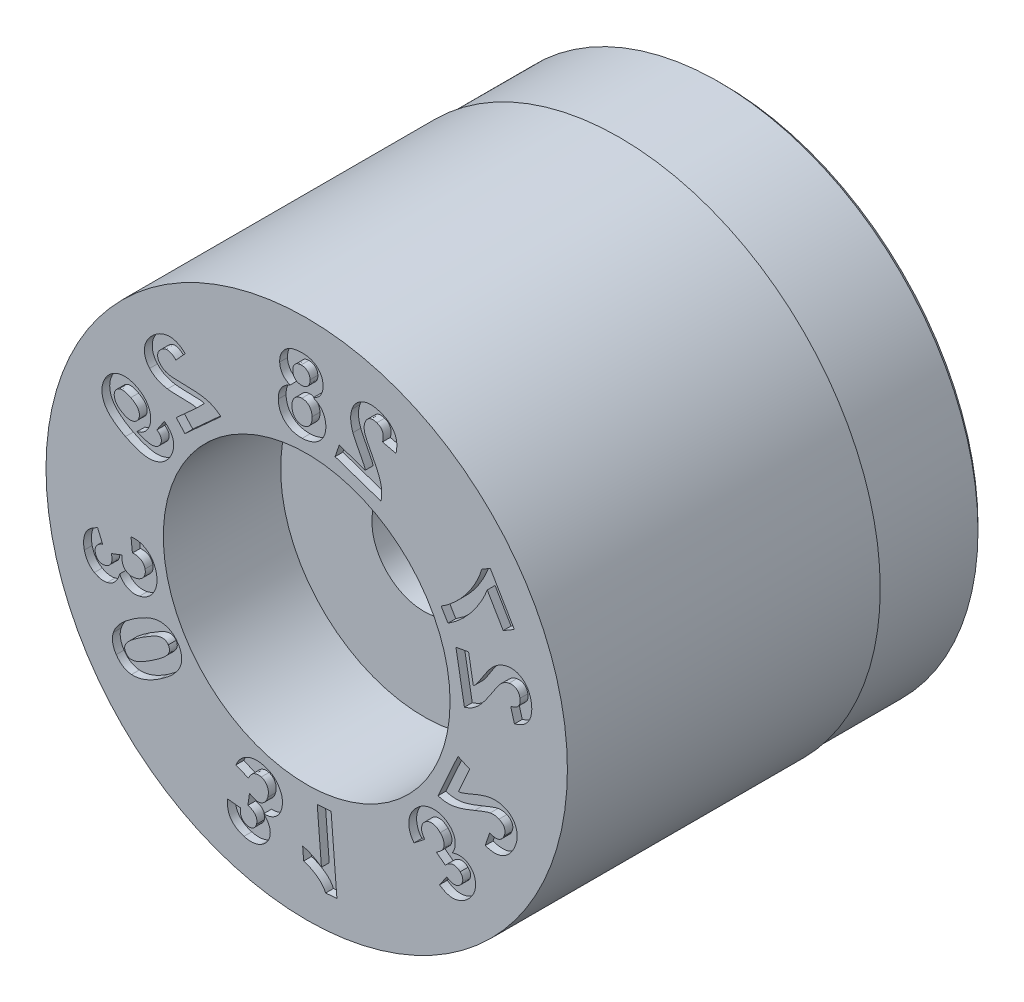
from build123d import *

# Parameters (mm, degrees)
SKETCH4_W          = 4
SKETCH4_H          = 1
CUT_EXTRUDE1_DEPTH = 0.3


with BuildPart() as part:
    # Sketch1 → Revolve1 (revolve)
    with BuildSketch(Plane(origin=(0, 0, 0), x_dir=(0, 0, -1), z_dir=(1, 0, 0)), mode=Mode.PRIVATE) as revolve1_sk:
        Polygon((0, 10), (0, 5.5), (4.5, 5.5), (4.5, 2), (16, 2), (16, 9.75), (15.75, 10), align=None)
    revolve(revolve1_sk.sketch.rotate(Axis((0, 0, 3.797909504), (0, 0, -1)), 90), axis=Axis((0, 0, 3.797909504), (0, 0, -1)))

    # Sketch4 → Cut-Revolve1 (revolve, cut)
    with BuildSketch(Plane(origin=(0, 0, 0), x_dir=(0, 0, -1), z_dir=(1, 0, 0)), mode=Mode.PRIVATE) as cut_revolve1_sk:
        with Locations((14, 10.435)):
            Rectangle(SKETCH4_W, SKETCH4_H)
    revolve(cut_revolve1_sk.sketch.rotate(Axis((0, 0, 0), (0, 0, -1)), 90), axis=Axis((0, 0, 0), (0, 0, -1)), mode=Mode.SUBTRACT)

    # Sketch6 → Cut-Extrude1 (cut)
    # profile 1 of 12: a face of its own
    with BuildSketch(Plane.XY):
        with BuildLine():
            Line((6.209333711, 2.011990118), (5.723956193, 1.925613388))
            Line((5.723956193, 1.925613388), (6.050039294, 0.094737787))
            add(Edge.make_bspline(
                [(6.050039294, 0.094737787), (6.094354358, 0.109172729), (6.183006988, 0.138049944), (6.309076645, 0.199949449), (6.428580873, 0.275807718), (6.523825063, 0.350471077), (6.598753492, 0.421020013), (6.658787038, 0.484434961), (6.722217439, 0.557553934), (6.789175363, 0.640642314), (6.859343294, 0.733755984), (6.932715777, 0.837071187), (7.009997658, 0.949976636), (7.061736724, 1.029115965), (7.08852315, 1.070088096)],
                knots=[0, 0, 0, 0, 1.148861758, 2.298306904, 3.453744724, 4.63692093, 5.27782208, 5.991693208, 6.790648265, 7.665694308, 8.624208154, 9.66704015, 10.792176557, 12, 12, 12, 12], degree=3))
            add(Edge.make_bspline(
                [(7.08852315, 1.070088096), (7.109923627, 1.102739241), (7.150757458, 1.165040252), (7.209058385, 1.253732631), (7.262725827, 1.332374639), (7.311300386, 1.401317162), (7.355004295, 1.460546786), (7.393474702, 1.51010101), (7.426277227, 1.550450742), (7.447783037, 1.572862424), (7.457338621, 1.58282051)],
                knots=[0, 0, 0, 0, 1.481704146, 2.827210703, 4.028272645, 5.095070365, 6.027981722, 6.82153751, 7.476378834, 8, 8, 8, 8], degree=3))
            add(Edge.make_bspline(
                [(7.457338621, 1.58282051), (7.480891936, 1.604035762), (7.526392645, 1.645019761), (7.601673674, 1.692798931), (7.677981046, 1.729298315), (7.731303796, 1.741683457), (7.757525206, 1.747773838)],
                knots=[0, 0, 0, 0, 1.093768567, 2.112961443, 3.072050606, 4, 4, 4, 4], degree=3))
            add(Edge.make_bspline(
                [(7.757525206, 1.747773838), (7.785289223, 1.751715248), (7.838051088, 1.75920538), (7.914782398, 1.754133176), (7.983838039, 1.736298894), (8.044001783, 1.703429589), (8.095270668, 1.658734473), (8.13608297, 1.601923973), (8.166506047, 1.534253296), (8.17723202, 1.484408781), (8.182821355, 1.458434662)],
                knots=[0, 0, 0, 0, 1.149667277, 2.184791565, 3.137708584, 4.057726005, 4.975591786, 5.909521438, 6.910645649, 8, 8, 8, 8], degree=3))
            add(Edge.make_bspline(
                [(8.182821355, 1.458434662), (8.186302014, 1.43230945), (8.193003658, 1.382008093), (8.187139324, 1.307975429), (8.166835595, 1.240117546), (8.138493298, 1.188899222), (8.108055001, 1.152404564), (8.081330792, 1.126023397), (8.049216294, 1.102604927), (8.013294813, 1.079951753), (7.971943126, 1.060525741), (7.926762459, 1.041820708), (7.876937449, 1.025264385), (7.841914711, 1.016207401), (7.823737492, 1.011506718)],
                knots=[0, 0, 0, 0, 1.461940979, 2.814814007, 4.09091683, 5.373603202, 6.034842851, 6.728053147, 7.454652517, 8.239274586, 9.085094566, 9.989706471, 10.956633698, 12, 12, 12, 12], degree=3))
            Line((7.823737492, 1.011506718), (7.968299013, 0.499820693))
            add(Edge.make_bspline(
                [(7.968299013, 0.499820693), (8.002236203, 0.510439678), (8.068142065, 0.531061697), (8.161291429, 0.569081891), (8.245761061, 0.611964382), (8.321161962, 0.66033138), (8.388169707, 0.713036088), (8.446601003, 0.770747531), (8.496379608, 0.833454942), (8.536426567, 0.901662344), (8.569047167, 0.973051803), (8.595278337, 1.04720566), (8.614613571, 1.123985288), (8.628065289, 1.203624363), (8.634241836, 1.286148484), (8.634607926, 1.371516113), (8.627722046, 1.459458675), (8.618358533, 1.51848972), (8.613594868, 1.54852162)],
                knots=[0, 0, 0, 0, 1.238472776, 2.40510829, 3.500695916, 4.534349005, 5.521042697, 6.465529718, 7.389419, 8.3019406, 9.213927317, 10.120501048, 11.038377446, 11.969130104, 12.930889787, 13.918185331, 14.940881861, 16, 16, 16, 16], degree=3))
            add(Edge.make_bspline(
                [(8.613594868, 1.54852162), (8.607314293, 1.581208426), (8.595055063, 1.64501072), (8.567335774, 1.736056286), (8.53533836, 1.82083477), (8.496781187, 1.89888514), (8.452566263, 1.970568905), (8.402007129, 2.035327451), (8.346245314, 2.094019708), (8.284279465, 2.144524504), (8.218985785, 2.188764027), (8.150936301, 2.225259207), (8.08095724, 2.254313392), (8.008633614, 2.27418987), (7.934877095, 2.288109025), (7.858725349, 2.29279494), (7.780627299, 2.289780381), (7.728370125, 2.281964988), (7.701799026, 2.277991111)],
                knots=[0, 0, 0, 0, 1.216625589, 2.374765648, 3.475837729, 4.527822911, 5.553792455, 6.550820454, 7.527782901, 8.50832879, 9.468635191, 10.408515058, 11.328074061, 12.233565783, 13.147180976, 14.068568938, 15.017929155, 16, 16, 16, 16], degree=3))
            add(Edge.make_bspline(
                [(7.701799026, 2.277991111), (7.671652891, 2.271828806), (7.611787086, 2.259591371), (7.524807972, 2.231413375), (7.441593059, 2.195031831), (7.361041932, 2.150996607), (7.283148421, 2.096643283), (7.205404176, 2.033593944), (7.127102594, 1.960850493), (7.077400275, 1.906791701), (7.05169966, 1.878838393)],
                knots=[0, 0, 0, 0, 0.948147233, 1.882881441, 2.812428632, 3.745080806, 4.708387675, 5.736522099, 6.829576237, 8, 8, 8, 8], degree=3))
            add(Edge.make_bspline(
                [(7.05169966, 1.878838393), (7.042563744, 1.868371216), (7.022947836, 1.845896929), (6.993272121, 1.80856797), (6.961710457, 1.765583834), (6.926847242, 1.717963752), (6.889830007, 1.664661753), (6.850248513, 1.605861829), (6.808158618, 1.541830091), (6.76492196, 1.474358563), (6.722414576, 1.407579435), (6.682709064, 1.345123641), (6.645597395, 1.290176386), (6.613516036, 1.240646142), (6.584972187, 1.197990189), (6.559570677, 1.162142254), (6.538264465, 1.132617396), (6.50575774, 1.089789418), (6.460217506, 1.035578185), (6.415499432, 0.994231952), (6.394212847, 0.974550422)],
                knots=[0, 0, 0, 0, 0.66944087, 1.43737003, 2.297015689, 3.239063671, 4.281255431, 5.423907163, 6.654659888, 7.973659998, 9.285471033, 10.469327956, 11.53976018, 12.480385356, 13.3130262, 14.012761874, 14.597481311, 15.067362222, 16.604013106, 18, 18, 18, 18], degree=3))
            Line((6.394212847, 0.974550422), (6.209333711, 2.011990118))
        make_face()
    # profile 2 of 12: a face of its own
    with BuildSketch(Plane.XY):
        with BuildLine():
            Line((7.538572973, 3.385601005), (7.96411547, 3.635672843))
            Line((7.96411547, 3.635672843), (7.042388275, 5.203148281))
            Line((7.042388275, 5.203148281), (6.710091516, 5.007812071))
            add(Edge.make_bspline(
                [(6.710091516, 5.007812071), (6.70309182, 4.981609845), (6.688719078, 4.927807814), (6.661955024, 4.846119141), (6.629220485, 4.761642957), (6.59293322, 4.67340291), (6.550195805, 4.582577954), (6.50380241, 4.487722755), (6.451085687, 4.390107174), (6.374856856, 4.255448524), (6.270702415, 4.088344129), (6.132209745, 3.895378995), (5.980448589, 3.711373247), (5.844112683, 3.566465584), (5.731826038, 3.455614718), (5.647271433, 3.378135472), (5.564480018, 3.304394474), (5.481563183, 3.236331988), (5.399720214, 3.172720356), (5.318380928, 3.114396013), (5.238100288, 3.060563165), (5.183810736, 3.027921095), (5.157115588, 3.011870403)],
                knots=[0, 0, 0, 0, 0.629933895, 1.293467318, 1.995511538, 2.734125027, 3.509261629, 4.326705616, 5.186744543, 6.085814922, 7.921105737, 9.757593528, 11.599296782, 13.457431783, 14.376791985, 15.264024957, 16.121196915, 16.951905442, 17.755431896, 18.528668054, 19.276519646, 20, 20, 20, 20], degree=3))
            Line((5.157115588, 3.011870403), (5.417272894, 2.569824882))
            add(Edge.make_bspline(
                [(5.417272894, 2.569824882), (5.457798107, 2.595876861), (5.53905951, 2.648116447), (5.657538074, 2.732919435), (5.772597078, 2.824317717), (5.885775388, 2.920904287), (5.995420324, 3.024427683), (6.102855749, 3.133333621), (6.207194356, 3.248625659), (6.308372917, 3.369012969), (6.405668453, 3.49343684), (6.497539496, 3.620702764), (6.583322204, 3.75029646), (6.664258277, 3.881247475), (6.737995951, 4.014961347), (6.806810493, 4.150101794), (6.86985052, 4.287449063), (6.907036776, 4.380870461), (6.925632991, 4.427588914)],
                knots=[0, 0, 0, 0, 0.950501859, 1.905952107, 2.873349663, 3.849172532, 4.840849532, 5.84776629, 6.866988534, 7.908107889, 8.950089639, 9.98286174, 11.004284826, 12.016069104, 13.019506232, 14.016248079, 15.007959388, 16, 16, 16, 16], degree=3))
            Line((6.925632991, 4.427588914), (7.538572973, 3.385601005))
        make_face()
    # profile 3 of 12: a face of its own
    with BuildSketch(Plane.XY):
        with BuildLine():
            Line((1.248268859, 6.404734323), (1.089074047, 5.938224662))
            Line((1.089074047, 5.938224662), (2.849579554, 5.338180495))
            add(Edge.make_bspline(
                [(2.849579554, 5.338180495), (2.858335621, 5.384079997), (2.875789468, 5.475573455), (2.882021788, 5.615843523), (2.874356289, 5.756990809), (2.854912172, 5.876472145), (2.82975869, 5.976235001), (2.803547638, 6.059472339), (2.769787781, 6.150382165), (2.72938374, 6.249321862), (2.681841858, 6.355956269), (2.627155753, 6.470256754), (2.565925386, 6.592538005), (2.521498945, 6.676061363), (2.498514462, 6.719273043)],
                knots=[0, 0, 0, 0, 1.151528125, 2.295390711, 3.453110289, 4.634461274, 5.274883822, 5.990210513, 6.786203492, 7.666729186, 8.626440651, 9.666121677, 10.792543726, 12, 12, 12, 12], degree=3))
            add(Edge.make_bspline(
                [(2.498514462, 6.719273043), (2.480131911, 6.753661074), (2.445029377, 6.819326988), (2.395956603, 6.913554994), (2.353469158, 6.998809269), (2.31653484, 7.074582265), (2.286034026, 7.141390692), (2.26071143, 7.198753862), (2.241566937, 7.247204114), (2.232372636, 7.276954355), (2.228282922, 7.290187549)],
                knots=[0, 0, 0, 0, 1.479812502, 2.825786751, 4.031705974, 5.094726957, 6.024668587, 6.818602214, 7.47450287, 8, 8, 8, 8], degree=3))
            add(Edge.make_bspline(
                [(2.228282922, 7.290187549), (2.221394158, 7.32099112), (2.20808485, 7.380504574), (2.200993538, 7.469233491), (2.207820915, 7.553596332), (2.222680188, 7.606347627), (2.23000247, 7.632342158)],
                knots=[0, 0, 0, 0, 1.090899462, 2.107651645, 3.067497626, 4, 4, 4, 4], degree=3))
            add(Edge.make_bspline(
                [(2.23000247, 7.632342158), (2.239916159, 7.658424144), (2.25878543, 7.708067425), (2.299995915, 7.772968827), (2.3491926, 7.824782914), (2.406984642, 7.861935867), (2.470795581, 7.885386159), (2.540137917, 7.893311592), (2.613808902, 7.887528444), (2.662463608, 7.872803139), (2.687783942, 7.865139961)],
                knots=[0, 0, 0, 0, 1.145774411, 2.180815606, 3.140858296, 4.063072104, 4.982972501, 5.91323794, 6.914030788, 8, 8, 8, 8], degree=3))
            add(Edge.make_bspline(
                [(2.687783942, 7.865139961), (2.712491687, 7.855581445), (2.759795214, 7.837281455), (2.821982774, 7.79618549), (2.87122428, 7.745218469), (2.902272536, 7.695540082), (2.920297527, 7.651618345), (2.92988285, 7.615059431), (2.934309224, 7.575446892), (2.937085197, 7.532910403), (2.934408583, 7.487359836), (2.929185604, 7.438658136), (2.919756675, 7.38694714), (2.910792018, 7.351756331), (2.906142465, 7.333504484)],
                knots=[0, 0, 0, 0, 1.466596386, 2.807831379, 4.097170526, 5.370600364, 6.030586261, 6.725584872, 7.458993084, 8.238616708, 9.08747137, 9.985769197, 10.955311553, 12, 12, 12, 12], degree=3))
            Line((2.906142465, 7.333504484), (3.423545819, 7.213688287))
            add(Edge.make_bspline(
                [(3.423545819, 7.213688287), (3.430750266, 7.248584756), (3.444705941, 7.316182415), (3.456259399, 7.416010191), (3.459384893, 7.510438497), (3.455020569, 7.599741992), (3.440043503, 7.683712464), (3.418521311, 7.762822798), (3.386988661, 7.836302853), (3.347420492, 7.904322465), (3.301004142, 7.967703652), (3.248466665, 8.026384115), (3.190585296, 8.080988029), (3.127252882, 8.131331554), (3.057802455, 8.176714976), (2.983040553, 8.217863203), (2.902932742, 8.254972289), (2.84672907, 8.275477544), (2.818102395, 8.285921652)],
                knots=[0, 0, 0, 0, 1.241010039, 2.403950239, 3.495890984, 4.53028026, 5.512249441, 6.461994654, 7.380672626, 8.289132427, 9.198222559, 10.112966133, 11.029470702, 11.967573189, 12.927804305, 13.916319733, 14.938702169, 16, 16, 16, 16], degree=3))
            add(Edge.make_bspline(
                [(2.818102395, 8.285921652), (2.786470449, 8.296033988), (2.724552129, 8.315828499), (2.631709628, 8.336480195), (2.541690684, 8.348785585), (2.454827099, 8.353000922), (2.370612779, 8.348493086), (2.289414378, 8.336433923), (2.211293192, 8.314693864), (2.136833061, 8.285627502), (2.066704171, 8.249659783), (2.001546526, 8.208246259), (1.943016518, 8.160083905), (1.889006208, 8.107884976), (1.842744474, 8.048497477), (1.800973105, 7.984805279), (1.765737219, 7.914894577), (1.747356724, 7.865421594), (1.737996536, 7.840227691)],
                knots=[0, 0, 0, 0, 1.213748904, 2.375866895, 3.472206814, 4.532336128, 5.550370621, 6.551253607, 7.527436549, 8.508704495, 9.468887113, 10.405118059, 11.325364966, 12.236066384, 13.145355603, 14.071272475, 15.017803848, 16, 16, 16, 16], degree=3))
            add(Edge.make_bspline(
                [(1.737996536, 7.840227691), (1.728704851, 7.810733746), (1.710286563, 7.752269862), (1.693325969, 7.662302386), (1.684889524, 7.571896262), (1.685010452, 7.480185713), (1.694403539, 7.385841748), (1.711758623, 7.287321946), (1.737427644, 7.18366704), (1.760902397, 7.114046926), (1.773019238, 7.078111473)],
                knots=[0, 0, 0, 0, 0.952733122, 1.88853946, 2.816106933, 3.748907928, 4.711426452, 5.735516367, 6.83115324, 8, 8, 8, 8], degree=3))
            add(Edge.make_bspline(
                [(1.773019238, 7.078111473), (1.77782626, 7.06511828), (1.78818585, 7.037116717), (1.806223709, 6.993155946), (1.827907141, 6.944363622), (1.85328796, 6.891050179), (1.882037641, 6.832780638), (1.914236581, 6.769772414), (1.949800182, 6.701982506), (1.987887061, 6.63143702), (2.02554105, 6.561782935), (2.061074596, 6.496981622), (2.092122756, 6.438426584), (2.119233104, 6.386146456), (2.143085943, 6.340472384), (2.162159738, 6.300746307), (2.178568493, 6.268068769), (2.199466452, 6.218539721), (2.225277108, 6.152550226), (2.238836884, 6.092967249), (2.245285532, 6.064631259)],
                knots=[0, 0, 0, 0, 0.667350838, 1.438204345, 2.28856734, 3.239195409, 4.282463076, 5.418599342, 6.647781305, 7.970148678, 9.280622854, 10.462155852, 11.530319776, 12.473279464, 13.299252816, 14.012209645, 14.596261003, 15.059911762, 16.601776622, 18, 18, 18, 18], degree=3))
            Line((2.245285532, 6.064631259), (1.248268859, 6.404734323))
        make_face()
    # profile 4 of 12: a face of its own
    with BuildSketch(Plane.XY):
        with BuildLine():
            add(Edge.make_bspline(
                [(0.25179767, 7.47897016), (0.268332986, 7.486742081), (0.300764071, 7.501985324), (0.346531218, 7.528011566), (0.388609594, 7.55614827), (0.426852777, 7.586563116), (0.462490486, 7.617874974), (0.494027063, 7.651695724), (0.521433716, 7.687864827), (0.553782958, 7.737887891), (0.586133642, 7.804126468), (0.612621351, 7.887772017), (0.629337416, 7.974287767), (0.629569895, 8.033262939), (0.629687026, 8.062976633)],
                knots=[0, 0, 0, 0, 0.886650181, 1.73900689, 2.553055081, 3.341191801, 4.109428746, 4.853980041, 5.581464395, 6.309458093, 7.743700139, 9.142705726, 10.560398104, 12, 12, 12, 12], degree=3))
            add(Edge.make_bspline(
                [(0.629687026, 8.062976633), (0.628512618, 8.088402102), (0.626208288, 8.138289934), (0.613474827, 8.210984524), (0.594822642, 8.280043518), (0.569165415, 8.345465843), (0.537307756, 8.40764464), (0.497925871, 8.46586813), (0.451857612, 8.520404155), (0.400051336, 8.571678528), (0.341432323, 8.617364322), (0.276975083, 8.656674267), (0.207417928, 8.690706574), (0.131665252, 8.716410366), (0.050774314, 8.73655871), (-0.035490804, 8.749608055), (-0.127306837, 8.756758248), (-0.19027059, 8.756099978), (-0.2226814, 8.755761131)],
                knots=[0, 0, 0, 0, 0.985366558, 1.933407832, 2.852782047, 3.753120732, 4.651270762, 5.554519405, 6.470232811, 7.413695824, 8.37394839, 9.342554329, 10.334715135, 11.367922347, 12.435849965, 13.561161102, 14.744599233, 16, 16, 16, 16], degree=3))
            add(Edge.make_bspline(
                [(-0.2226814, 8.755761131), (-0.254638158, 8.754387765), (-0.316966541, 8.751709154), (-0.407559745, 8.739279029), (-0.49263669, 8.721471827), (-0.57231403, 8.697993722), (-0.645603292, 8.666861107), (-0.713269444, 8.629975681), (-0.775597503, 8.587226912), (-0.831774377, 8.538215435), (-0.881475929, 8.484454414), (-0.925181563, 8.427613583), (-0.960605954, 8.366680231), (-0.990163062, 8.303200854), (-1.012583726, 8.236264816), (-1.028023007, 8.166187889), (-1.035872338, 8.092834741), (-1.03603927, 8.043067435), (-1.036124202, 8.017746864)],
                knots=[0, 0, 0, 0, 1.240325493, 2.419127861, 3.542443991, 4.610272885, 5.635856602, 6.625332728, 7.595641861, 8.561957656, 9.510913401, 10.43218928, 11.337450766, 12.239422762, 13.144538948, 14.070144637, 15.018129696, 16, 16, 16, 16], degree=3))
            add(Edge.make_bspline(
                [(-1.036124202, 8.017746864), (-1.034072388, 7.986328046), (-1.030060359, 7.924893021), (-1.008443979, 7.835871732), (-0.974755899, 7.752510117), (-0.928100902, 7.675746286), (-0.871157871, 7.605829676), (-0.802804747, 7.545479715), (-0.724841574, 7.493819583), (-0.667187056, 7.467955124), (-0.637753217, 7.454750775)],
                knots=[0, 0, 0, 0, 1.030396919, 2.014794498, 2.987661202, 3.966339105, 4.948081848, 5.93171618, 6.944097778, 8, 8, 8, 8], degree=3))
            add(Edge.make_bspline(
                [(-0.637753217, 7.454750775), (-0.656327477, 7.4463467), (-0.692887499, 7.429804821), (-0.744798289, 7.401019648), (-0.793303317, 7.369819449), (-0.83827612, 7.335914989), (-0.879734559, 7.299372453), (-0.917509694, 7.260388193), (-0.951712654, 7.218724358), (-0.982195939, 7.17480241), (-1.009141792, 7.128630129), (-1.032505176, 7.080900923), (-1.051692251, 7.03128676), (-1.067698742, 6.980429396), (-1.079635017, 6.92776995), (-1.08709163, 6.873405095), (-1.091818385, 6.817472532), (-1.091431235, 6.779682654), (-1.091235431, 6.760570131)],
                knots=[0, 0, 0, 0, 1.10537913, 2.175735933, 3.215933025, 4.231266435, 5.22742883, 6.210445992, 7.172260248, 8.147927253, 9.107011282, 10.069306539, 11.02688831, 11.989450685, 12.958932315, 13.95131969, 14.963864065, 16, 16, 16, 16], degree=3))
            add(Edge.make_bspline(
                [(-1.091235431, 6.760570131), (-1.089845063, 6.729349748), (-1.087115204, 6.668051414), (-1.07221171, 6.578827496), (-1.05115847, 6.493921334), (-1.022134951, 6.413736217), (-0.985496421, 6.338212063), (-0.940786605, 6.267838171), (-0.889525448, 6.201384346), (-0.830180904, 6.141020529), (-0.764852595, 6.086495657), (-0.694374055, 6.038903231), (-0.61865656, 5.999539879), (-0.538320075, 5.967645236), (-0.453128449, 5.943391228), (-0.36299076, 5.92793706), (-0.268265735, 5.918209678), (-0.203492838, 5.91887077), (-0.170313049, 5.919209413)],
                knots=[0, 0, 0, 0, 1.06711705, 2.095185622, 3.085119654, 4.053307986, 5.003879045, 5.947812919, 6.89786846, 7.866794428, 8.834328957, 9.80169469, 10.767096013, 11.744851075, 12.751105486, 13.787952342, 14.866882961, 16, 16, 16, 16], degree=3))
            add(Edge.make_bspline(
                [(-0.170313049, 5.919209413), (-0.139475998, 5.92053193), (-0.078824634, 5.923133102), (0.009883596, 5.935529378), (0.094599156, 5.953293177), (0.175042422, 5.977291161), (0.251472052, 6.00700111), (0.323329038, 6.043887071), (0.391759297, 6.085886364), (0.433657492, 6.118978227), (0.454590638, 6.135511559)],
                knots=[0, 0, 0, 0, 1.098506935, 2.160580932, 3.185056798, 4.178117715, 5.146548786, 6.100338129, 7.050892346, 8, 8, 8, 8], degree=3))
            add(Edge.make_bspline(
                [(0.454590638, 6.135511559), (0.477746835, 6.156052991), (0.523377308, 6.196530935), (0.582544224, 6.265423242), (0.63146672, 6.339840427), (0.671738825, 6.419089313), (0.701996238, 6.503802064), (0.723168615, 6.593614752), (0.734554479, 6.688654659), (0.734547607, 6.753569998), (0.734544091, 6.786773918)],
                knots=[0, 0, 0, 0, 1.009546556, 1.989363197, 2.953623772, 3.910420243, 4.884059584, 5.882477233, 6.916896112, 8, 8, 8, 8], degree=3))
            add(Edge.make_bspline(
                [(0.734544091, 6.786773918), (0.732045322, 6.823591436), (0.727104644, 6.896388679), (0.703168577, 7.002821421), (0.664702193, 7.103732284), (0.622161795, 7.183214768), (0.581369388, 7.243248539), (0.545475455, 7.284887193), (0.507037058, 7.325196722), (0.463094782, 7.361019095), (0.416369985, 7.395617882), (0.365084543, 7.42635507), (0.310046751, 7.454485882), (0.271459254, 7.470705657), (0.25179767, 7.47897016)],
                knots=[0, 0, 0, 0, 1.477335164, 2.921053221, 4.352351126, 5.793656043, 6.523597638, 7.256417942, 7.994429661, 8.752555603, 9.524915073, 10.322979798, 11.145503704, 12, 12, 12, 12], degree=3))
        make_face()
        with BuildLine():
            add(Edge.make_bspline(
                [(0.126898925, 8.01155671), (0.126718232, 7.986336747), (0.12637309, 7.938163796), (0.111376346, 7.869775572), (0.084078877, 7.810061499), (0.046118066, 7.759167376), (-0.002097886, 7.718328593), (-0.058819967, 7.688677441), (-0.123488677, 7.67051326), (-0.169091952, 7.66716723), (-0.192852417, 7.665423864)],
                knots=[0, 0, 0, 0, 1.133230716, 2.164597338, 3.124700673, 4.068804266, 4.999795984, 5.945137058, 6.929364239, 8, 8, 8, 8], degree=3))
            add(Edge.make_bspline(
                [(-0.192852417, 7.665423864), (-0.216987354, 7.665585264), (-0.263438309, 7.665895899), (-0.329285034, 7.682460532), (-0.388679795, 7.708455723), (-0.439240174, 7.74757641), (-0.48137282, 7.796259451), (-0.511529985, 7.855111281), (-0.530654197, 7.922477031), (-0.533532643, 7.970400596), (-0.535039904, 7.99549515)],
                knots=[0, 0, 0, 0, 1.074219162, 2.067480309, 3.008556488, 3.950410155, 4.897283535, 5.861230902, 6.880061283, 8, 8, 8, 8], degree=3))
            add(Edge.make_bspline(
                [(-0.535039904, 7.99549515), (-0.534815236, 8.019429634), (-0.534385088, 8.065254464), (-0.518622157, 8.130618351), (-0.491920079, 8.188937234), (-0.452615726, 8.238275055), (-0.405252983, 8.279684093), (-0.348935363, 8.309923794), (-0.285067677, 8.328771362), (-0.23995247, 8.332014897), (-0.216552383, 8.333697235)],
                knots=[0, 0, 0, 0, 1.095331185, 2.097115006, 3.060579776, 4.015410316, 4.969585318, 5.92903045, 6.925841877, 8, 8, 8, 8], degree=3))
            add(Edge.make_bspline(
                [(-0.216552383, 8.333697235), (-0.192254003, 8.333211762), (-0.145551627, 8.332278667), (-0.078613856, 8.317185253), (-0.019415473, 8.289500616), (0.031486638, 8.250822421), (0.072720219, 8.20238859), (0.103057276, 8.145623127), (0.121957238, 8.080997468), (0.125207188, 8.035329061), (0.126898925, 8.01155671)],
                knots=[0, 0, 0, 0, 1.097530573, 2.109493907, 3.078221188, 4.032363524, 4.979733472, 5.93323825, 6.92416248, 8, 8, 8, 8], degree=3))
        make_face(mode=Mode.SUBTRACT)
        with BuildLine():
            add(Edge.make_bspline(
                [(0.208512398, 6.823989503), (0.208533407, 6.806190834), (0.208574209, 6.771624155), (0.205333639, 6.721034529), (0.197600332, 6.673332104), (0.186695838, 6.628321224), (0.172027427, 6.586328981), (0.153826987, 6.547164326), (0.131287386, 6.511335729), (0.106441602, 6.477801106), (0.078090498, 6.448386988), (0.047930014, 6.422422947), (0.015793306, 6.400289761), (-0.018423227, 6.382301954), (-0.054101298, 6.367018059), (-0.092013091, 6.357147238), (-0.131386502, 6.349304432), (-0.158440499, 6.348225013), (-0.172288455, 6.347672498)],
                knots=[0, 0, 0, 0, 1.245841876, 2.419541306, 3.54389523, 4.624511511, 5.657472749, 6.652939, 7.640457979, 8.615759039, 9.56939193, 10.493467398, 11.398058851, 12.293897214, 13.196308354, 14.107691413, 15.031396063, 16, 16, 16, 16], degree=3))
            add(Edge.make_bspline(
                [(-0.172288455, 6.347672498), (-0.18579746, 6.347574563), (-0.21223098, 6.34738293), (-0.25100305, 6.352487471), (-0.288251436, 6.360387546), (-0.323665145, 6.372688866), (-0.357581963, 6.388386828), (-0.389458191, 6.40832145), (-0.42021862, 6.431315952), (-0.44844289, 6.458757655), (-0.474896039, 6.488943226), (-0.497637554, 6.523394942), (-0.517623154, 6.560784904), (-0.53368574, 6.601857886), (-0.546724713, 6.645880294), (-0.556616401, 6.693246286), (-0.562374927, 6.744244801), (-0.564245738, 6.779384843), (-0.565210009, 6.79749704)],
                knots=[0, 0, 0, 0, 0.962224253, 1.882816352, 2.782017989, 3.673277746, 4.550060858, 5.441320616, 6.34947171, 7.283195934, 8.243200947, 9.205794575, 10.219824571, 11.261181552, 12.344451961, 13.490858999, 14.706715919, 16, 16, 16, 16], degree=3))
            add(Edge.make_bspline(
                [(-0.565210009, 6.79749704), (-0.565365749, 6.813420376), (-0.565669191, 6.844445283), (-0.561989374, 6.890008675), (-0.553961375, 6.932967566), (-0.543340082, 6.973871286), (-0.528939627, 7.012404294), (-0.511421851, 7.049037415), (-0.489342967, 7.082630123), (-0.46457904, 7.113941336), (-0.436932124, 7.142118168), (-0.407454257, 7.167496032), (-0.375799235, 7.188943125), (-0.342276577, 7.206618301), (-0.306725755, 7.220170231), (-0.269365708, 7.230821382), (-0.229940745, 7.237249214), (-0.202975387, 7.238977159), (-0.189345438, 7.239850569)],
                knots=[0, 0, 0, 0, 1.172941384, 2.28535016, 3.361250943, 4.389349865, 5.395055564, 6.387847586, 7.374311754, 8.350138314, 9.324992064, 10.278292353, 11.211474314, 12.136076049, 13.063955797, 14.009761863, 14.99401131, 16, 16, 16, 16], degree=3))
            add(Edge.make_bspline(
                [(-0.189345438, 7.239850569), (-0.173594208, 7.239845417), (-0.142868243, 7.239835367), (-0.098259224, 7.235130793), (-0.056733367, 7.225292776), (-0.01815454, 7.211518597), (0.01796366, 7.194100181), (0.050229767, 7.170953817), (0.080219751, 7.144484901), (0.114320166, 7.103013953), (0.150296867, 7.04717271), (0.182603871, 6.975899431), (0.203044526, 6.901023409), (0.206679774, 6.849808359), (0.208512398, 6.823989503)],
                knots=[0, 0, 0, 0, 0.877422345, 1.711589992, 2.493011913, 3.249589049, 3.991386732, 4.718776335, 5.455507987, 6.214019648, 7.702764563, 9.144237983, 10.560335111, 12, 12, 12, 12], degree=3))
        make_face(mode=Mode.SUBTRACT)
    # profile 5 of 12: a face of its own
    with BuildSketch(Plane.XY):
        with BuildLine():
            Line((-5.003400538, 4.189501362), (-4.670922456, 3.823622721))
            Line((-4.670922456, 3.823622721), (-3.291460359, 5.077162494))
            add(Edge.make_bspline(
                [(-3.291460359, 5.077162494), (-3.327458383, 5.106946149), (-3.399374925, 5.166447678), (-3.519142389, 5.240310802), (-3.647003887, 5.302045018), (-3.761273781, 5.343224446), (-3.861282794, 5.369233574), (-3.947118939, 5.386297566), (-4.043078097, 5.401053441), (-4.149383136, 5.413481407), (-4.265857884, 5.423470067), (-4.392506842, 5.43134608), (-4.52937733, 5.435751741), (-4.624008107, 5.437467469), (-4.673127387, 5.43835804)],
                knots=[0, 0, 0, 0, 1.148970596, 2.295403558, 3.453006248, 4.639559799, 5.27815695, 5.995308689, 6.792840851, 7.667477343, 8.629408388, 9.670186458, 10.790681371, 12, 12, 12, 12], degree=3))
            add(Edge.make_bspline(
                [(-4.673127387, 5.43835804), (-4.712329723, 5.438856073), (-4.786949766, 5.439804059), (-4.893372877, 5.442909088), (-4.988824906, 5.44651589), (-5.07333982, 5.450467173), (-5.14684009, 5.456014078), (-5.209419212, 5.461772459), (-5.261054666, 5.468681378), (-5.291540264, 5.474942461), (-5.304974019, 5.477701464)],
                knots=[0, 0, 0, 0, 1.48446965, 2.825627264, 4.031196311, 5.101325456, 6.02896283, 6.821849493, 7.480837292, 8, 8, 8, 8], degree=3))
            add(Edge.make_bspline(
                [(-5.304974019, 5.477701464), (-5.335543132, 5.486354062), (-5.394608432, 5.503072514), (-5.475391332, 5.541340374), (-5.546552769, 5.58742519), (-5.585637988, 5.625914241), (-5.604891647, 5.644874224)],
                knots=[0, 0, 0, 0, 1.093586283, 2.113015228, 3.07045775, 4, 4, 4, 4], degree=3))
            add(Edge.make_bspline(
                [(-5.604891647, 5.644874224), (-5.623169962, 5.666225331), (-5.657880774, 5.706771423), (-5.694168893, 5.774785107), (-5.716097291, 5.842912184), (-5.720685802, 5.9115597), (-5.710241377, 5.978958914), (-5.683870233, 6.043727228), (-5.642701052, 6.105789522), (-5.606132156, 6.141664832), (-5.586975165, 6.16045848)],
                knots=[0, 0, 0, 0, 1.148412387, 2.180853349, 3.135343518, 4.059605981, 4.972660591, 5.905893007, 6.902980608, 8, 8, 8, 8], degree=3))
            add(Edge.make_bspline(
                [(-5.586975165, 6.16045848), (-5.56665891, 6.177513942), (-5.527741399, 6.210185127), (-5.461271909, 6.243964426), (-5.393066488, 6.263643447), (-5.334246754, 6.266635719), (-5.287023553, 6.26054547), (-5.250540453, 6.251139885), (-5.212964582, 6.237414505), (-5.175314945, 6.217412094), (-5.135933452, 6.193929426), (-5.09620729, 6.165018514), (-5.055168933, 6.131803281), (-5.028878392, 6.106698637), (-5.015269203, 6.093703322)],
                knots=[0, 0, 0, 0, 1.464470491, 2.805317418, 4.093180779, 5.369638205, 6.032407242, 6.72335128, 7.451441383, 8.241425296, 9.079385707, 9.988364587, 10.95868531, 12, 12, 12, 12], degree=3))
            Line((-5.015269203, 6.093703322), (-4.658449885, 6.489612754))
            add(Edge.make_bspline(
                [(-4.658449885, 6.489612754), (-4.685545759, 6.512852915), (-4.738144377, 6.557966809), (-4.820775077, 6.615759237), (-4.9018853, 6.665062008), (-4.983068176, 6.703733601), (-5.063901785, 6.731847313), (-5.144038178, 6.750923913), (-5.223700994, 6.759073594), (-5.302730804, 6.75778699), (-5.380712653, 6.746546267), (-5.457883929, 6.729500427), (-5.533787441, 6.705106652), (-5.608426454, 6.673599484), (-5.681924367, 6.63514281), (-5.754114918, 6.589263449), (-5.82562689, 6.537023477), (-5.870756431, 6.497340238), (-5.893803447, 6.47707457)],
                knots=[0, 0, 0, 0, 1.238995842, 2.405143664, 3.497194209, 4.532324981, 5.521300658, 6.464388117, 7.386408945, 8.294887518, 9.202042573, 10.117800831, 11.03686774, 11.966515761, 12.92819499, 13.913946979, 14.934682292, 16, 16, 16, 16], degree=3))
            add(Edge.make_bspline(
                [(-5.893803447, 6.47707457), (-5.918055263, 6.454229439), (-5.965322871, 6.409703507), (-6.027990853, 6.338002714), (-6.08298173, 6.265789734), (-6.128048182, 6.191214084), (-6.165042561, 6.115455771), (-6.193745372, 6.038269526), (-6.212554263, 5.959295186), (-6.222961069, 5.879879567), (-6.225791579, 5.80101519), (-6.220110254, 5.723845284), (-6.207163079, 5.649073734), (-6.186393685, 5.576783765), (-6.15796299, 5.50687421), (-6.121364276, 5.439667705), (-6.077479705, 5.37457777), (-6.042836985, 5.334599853), (-6.025247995, 5.314302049)],
                knots=[0, 0, 0, 0, 1.215613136, 2.369271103, 3.471932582, 4.525110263, 5.544436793, 6.545990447, 7.524749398, 8.501364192, 9.465690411, 10.400383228, 11.321065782, 12.231086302, 13.140876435, 14.070346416, 15.020265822, 16, 16, 16, 16], degree=3))
            add(Edge.make_bspline(
                [(-6.025247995, 5.314302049), (-6.003893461, 5.29207514), (-5.961474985, 5.24792379), (-5.891356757, 5.188943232), (-5.815793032, 5.138481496), (-5.735615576, 5.093881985), (-5.648398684, 5.056156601), (-5.553442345, 5.023424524), (-5.449717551, 4.995752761), (-5.377141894, 4.982451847), (-5.339617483, 4.975574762)],
                knots=[0, 0, 0, 0, 0.947779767, 1.882662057, 2.811740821, 3.739162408, 4.701335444, 5.730860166, 6.826767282, 8, 8, 8, 8], degree=3))
            add(Edge.make_bspline(
                [(-5.339617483, 4.975574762), (-5.32593636, 4.973362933), (-5.296562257, 4.968614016), (-5.24926474, 4.963922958), (-5.196181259, 4.959093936), (-5.137129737, 4.955946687), (-5.072232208, 4.952953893), (-5.001448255, 4.950695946), (-4.924778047, 4.948734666), (-4.844470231, 4.948345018), (-4.765082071, 4.947912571), (-4.690968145, 4.946669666), (-4.624381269, 4.94631665), (-4.56536744, 4.944074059), (-4.513859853, 4.942896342), (-4.469922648, 4.940484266), (-4.433247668, 4.93922074), (-4.379451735, 4.933535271), (-4.308805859, 4.924274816), (-4.249685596, 4.907651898), (-4.221600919, 4.899755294)],
                knots=[0, 0, 0, 0, 0.666072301, 1.430092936, 2.283986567, 3.228395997, 4.272381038, 5.407131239, 6.63277957, 7.959150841, 9.26761724, 10.449169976, 11.522494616, 12.468314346, 13.287985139, 13.99893535, 14.5837679, 15.051136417, 16.599162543, 18, 18, 18, 18], degree=3))
            Line((-4.221600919, 4.899755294), (-5.003400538, 4.189501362))
        make_face()
    # profile 6 of 12: a face of its own
    with BuildSketch(Plane.XY):
        with BuildLine():
            Line((-5.458787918, 3.84066809), (-5.747327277, 3.409702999))
            add(Edge.make_bspline(
                [(-5.747327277, 3.409702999), (-5.727136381, 3.394878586), (-5.689059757, 3.366922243), (-5.641536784, 3.318718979), (-5.606219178, 3.268677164), (-5.583572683, 3.215971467), (-5.573849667, 3.161328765), (-5.576286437, 3.105472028), (-5.588557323, 3.04799564), (-5.606041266, 3.011870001), (-5.61513691, 2.993076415)],
                knots=[0, 0, 0, 0, 1.232652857, 2.324575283, 3.319513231, 4.233777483, 5.128100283, 6.029040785, 6.97465091, 8, 8, 8, 8], degree=3))
            add(Edge.make_bspline(
                [(-5.61513691, 2.993076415), (-5.621849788, 2.981376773), (-5.63510083, 2.958281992), (-5.659306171, 2.92663836), (-5.68733029, 2.89864423), (-5.718878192, 2.874335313), (-5.75405086, 2.854072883), (-5.792256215, 2.836724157), (-5.834201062, 2.8232104), (-5.880236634, 2.8130273), (-5.932182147, 2.807823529), (-5.991326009, 2.811346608), (-6.058209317, 2.820653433), (-6.132973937, 2.837145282), (-6.215311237, 2.861069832), (-6.305444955, 2.891784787), (-6.403292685, 2.929504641), (-6.470630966, 2.958031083), (-6.505833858, 2.972944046)],
                knots=[0, 0, 0, 0, 0.657071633, 1.297041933, 1.935387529, 2.583099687, 3.232541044, 3.910030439, 4.625045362, 5.376652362, 6.205327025, 7.160619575, 8.256947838, 9.495457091, 10.88903338, 12.434995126, 14.136298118, 16, 16, 16, 16], degree=3))
            add(Edge.make_bspline(
                [(-6.505833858, 2.972944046), (-6.481525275, 2.979392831), (-6.43396731, 2.992009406), (-6.366305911, 3.019117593), (-6.303397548, 3.051917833), (-6.246120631, 3.092135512), (-6.192959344, 3.13712447), (-6.146269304, 3.189611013), (-6.102864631, 3.246887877), (-6.079460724, 3.289447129), (-6.067552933, 3.311101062)],
                knots=[0, 0, 0, 0, 1.054182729, 2.062431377, 3.050838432, 4.023434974, 4.992736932, 5.965112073, 6.964659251, 8, 8, 8, 8], degree=3))
            add(Edge.make_bspline(
                [(-6.067552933, 3.311101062), (-6.055817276, 3.335228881), (-6.032540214, 3.383085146), (-6.007286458, 3.458152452), (-5.990333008, 3.534291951), (-5.981957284, 3.611489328), (-5.981283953, 3.689753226), (-5.988773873, 3.769340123), (-6.00617824, 3.849744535), (-6.030076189, 3.930642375), (-6.062653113, 4.009752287), (-6.102699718, 4.085626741), (-6.151127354, 4.156814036), (-6.206510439, 4.2240058), (-6.270005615, 4.286328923), (-6.341113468, 4.344143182), (-6.420067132, 4.397465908), (-6.476704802, 4.428662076), (-6.505654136, 4.444607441)],
                knots=[0, 0, 0, 0, 0.949184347, 1.882657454, 2.796393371, 3.706212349, 4.626566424, 5.563413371, 6.529981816, 7.534783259, 8.546473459, 9.553931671, 10.566942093, 11.589467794, 12.632130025, 13.711467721, 14.830257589, 16, 16, 16, 16], degree=3))
            add(Edge.make_bspline(
                [(-6.505654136, 4.444607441), (-6.53654448, 4.459822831), (-6.596899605, 4.489551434), (-6.68976048, 4.523936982), (-6.78150392, 4.550000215), (-6.872543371, 4.566085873), (-6.962630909, 4.573599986), (-7.051885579, 4.570637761), (-7.140197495, 4.558639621), (-7.226863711, 4.537241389), (-7.310306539, 4.507990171), (-7.389151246, 4.470367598), (-7.462969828, 4.425624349), (-7.530940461, 4.372359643), (-7.594738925, 4.3126442), (-7.652479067, 4.24472156), (-7.705679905, 4.169579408), (-7.735520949, 4.114973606), (-7.750774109, 4.087062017)],
                knots=[0, 0, 0, 0, 1.134993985, 2.217608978, 3.260585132, 4.27650715, 5.261802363, 6.236622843, 7.215666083, 8.195834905, 9.175809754, 10.126680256, 11.072117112, 12.016527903, 12.969654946, 13.949222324, 14.951751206, 16, 16, 16, 16], degree=3))
            add(Edge.make_bspline(
                [(-7.750774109, 4.087062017), (-7.765725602, 4.056010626), (-7.795142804, 3.994916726), (-7.827293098, 3.899883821), (-7.84803391, 3.804229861), (-7.8575115, 3.708314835), (-7.855476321, 3.611625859), (-7.841883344, 3.514699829), (-7.817277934, 3.417052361), (-7.781482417, 3.318993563), (-7.732038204, 3.22100405), (-7.666325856, 3.124950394), (-7.585666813, 3.030211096), (-7.488500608, 2.938047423), (-7.377216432, 2.846074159), (-7.249255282, 2.75660574), (-7.106165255, 2.668299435), (-7.003745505, 2.613277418), (-6.950773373, 2.584819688)],
                knots=[0, 0, 0, 0, 0.859595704, 1.691262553, 2.497089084, 3.297846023, 4.091253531, 4.905240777, 5.735479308, 6.60031592, 7.505784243, 8.467288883, 9.498178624, 10.605593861, 11.805631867, 13.098630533, 14.499393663, 16, 16, 16, 16], degree=3))
            add(Edge.make_bspline(
                [(-6.950773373, 2.584819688), (-6.895995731, 2.557390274), (-6.790086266, 2.504357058), (-6.632549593, 2.436867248), (-6.482339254, 2.384041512), (-6.340249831, 2.344053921), (-6.205324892, 2.319050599), (-6.078102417, 2.306289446), (-5.958280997, 2.310041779), (-5.846085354, 2.326296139), (-5.741816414, 2.355556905), (-5.644197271, 2.393424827), (-5.553602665, 2.441308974), (-5.46983189, 2.498888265), (-5.392972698, 2.566255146), (-5.322935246, 2.643286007), (-5.260154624, 2.730136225), (-5.224936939, 2.793453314), (-5.207032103, 2.825644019)],
                knots=[0, 0, 0, 0, 1.475199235, 2.852214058, 4.12417743, 5.307809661, 6.403169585, 7.425397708, 8.380779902, 9.282928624, 10.148898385, 10.983268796, 11.80036523, 12.610921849, 13.425931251, 14.256209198, 15.113448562, 16, 16, 16, 16], degree=3))
            add(Edge.make_bspline(
                [(-5.207032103, 2.825644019), (-5.195116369, 2.849360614), (-5.171812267, 2.895744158), (-5.144126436, 2.966929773), (-5.123740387, 3.037210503), (-5.108371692, 3.106158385), (-5.100733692, 3.174526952), (-5.099359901, 3.241987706), (-5.104799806, 3.308488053), (-5.116930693, 3.373730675), (-5.135856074, 3.437660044), (-5.161251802, 3.500386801), (-5.194152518, 3.561168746), (-5.233292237, 3.620839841), (-5.279671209, 3.678646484), (-5.333120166, 3.734492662), (-5.392920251, 3.789117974), (-5.43641327, 3.823156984), (-5.458787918, 3.84066809)],
                knots=[0, 0, 0, 0, 1.100336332, 2.151974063, 3.161935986, 4.133174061, 5.077831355, 6.009930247, 6.927531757, 7.840073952, 8.757151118, 9.688217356, 10.641333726, 11.618835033, 12.644246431, 13.710137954, 14.821998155, 16, 16, 16, 16], degree=3))
        make_face()
        with BuildLine():
            add(Edge.make_bspline(
                [(-7.047533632, 3.307670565), (-7.065861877, 3.317738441), (-7.101538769, 3.337336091), (-7.151639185, 3.36931277), (-7.196734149, 3.402867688), (-7.236922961, 3.438090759), (-7.272146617, 3.475291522), (-7.30244843, 3.51417666), (-7.327517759, 3.554883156), (-7.347944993, 3.596328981), (-7.363591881, 3.638270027), (-7.375185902, 3.679480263), (-7.381429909, 3.719970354), (-7.383612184, 3.759171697), (-7.381649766, 3.797456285), (-7.374578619, 3.834596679), (-7.363715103, 3.871058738), (-7.352703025, 3.893936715), (-7.347132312, 3.905510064)],
                knots=[0, 0, 0, 0, 1.348309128, 2.62455449, 3.829433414, 4.969973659, 6.066386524, 7.128518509, 8.143118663, 9.144159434, 10.103372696, 11.026361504, 11.899907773, 12.739596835, 13.55495463, 14.364945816, 15.172870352, 16, 16, 16, 16], degree=3))
            add(Edge.make_bspline(
                [(-7.347132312, 3.905510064), (-7.335105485, 3.92611735), (-7.311589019, 3.966411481), (-7.260203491, 4.014232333), (-7.200043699, 4.050521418), (-7.142294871, 4.069038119), (-7.091851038, 4.076873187), (-7.050309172, 4.077521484), (-7.006094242, 4.073379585), (-6.959358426, 4.064135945), (-6.909686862, 4.050783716), (-6.85771028, 4.031670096), (-6.80265454, 4.008567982), (-6.765881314, 3.990059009), (-6.746815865, 3.980462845)],
                knots=[0, 0, 0, 0, 1.252529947, 2.449114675, 3.655452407, 4.934372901, 5.617933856, 6.342716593, 7.119252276, 7.956120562, 8.852569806, 9.829278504, 10.874567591, 12, 12, 12, 12], degree=3))
            add(Edge.make_bspline(
                [(-6.746815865, 3.980462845), (-6.727658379, 3.970341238), (-6.690625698, 3.950775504), (-6.639501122, 3.917682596), (-6.593272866, 3.8846627), (-6.552528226, 3.850551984), (-6.517371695, 3.815620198), (-6.487978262, 3.779567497), (-6.463039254, 3.743200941), (-6.444930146, 3.705166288), (-6.431290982, 3.667079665), (-6.421550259, 3.629372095), (-6.416728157, 3.591708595), (-6.415999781, 3.55460667), (-6.418837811, 3.517565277), (-6.427163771, 3.481210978), (-6.438807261, 3.444950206), (-6.450010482, 3.421951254), (-6.455704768, 3.410261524)],
                knots=[0, 0, 0, 0, 1.441514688, 2.78654284, 4.049868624, 5.221078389, 6.319759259, 7.342969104, 8.313990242, 9.246942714, 10.137601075, 11.004287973, 11.833719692, 12.658657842, 13.471301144, 14.299237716, 15.135549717, 16, 16, 16, 16], degree=3))
            add(Edge.make_bspline(
                [(-6.455704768, 3.410261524), (-6.468245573, 3.38878446), (-6.492855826, 3.346637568), (-6.546642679, 3.296542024), (-6.609910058, 3.258184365), (-6.67042187, 3.238089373), (-6.722780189, 3.229119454), (-6.764520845, 3.226731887), (-6.807862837, 3.228735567), (-6.852909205, 3.234803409), (-6.899535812, 3.246396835), (-6.947576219, 3.262709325), (-6.997748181, 3.282332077), (-7.030594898, 3.299049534), (-7.047533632, 3.307670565)],
                knots=[0, 0, 0, 0, 1.321352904, 2.593041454, 3.873627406, 5.247274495, 5.965968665, 6.705427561, 7.473947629, 8.278927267, 9.127632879, 10.03383108, 10.986065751, 12, 12, 12, 12], degree=3))
        make_face(mode=Mode.SUBTRACT)
    # profile 7 of 12: a face of its own
    with BuildSketch(Plane.XY):
        with BuildLine():
            Line((-6.740508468, -0.633730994), (-6.684449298, -1.148330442))
            add(Edge.make_bspline(
                [(-6.684449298, -1.148330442), (-6.65300708, -1.145859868), (-6.593015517, -1.141146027), (-6.50670616, -1.150622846), (-6.428773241, -1.17083164), (-6.361016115, -1.205883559), (-6.302995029, -1.250754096), (-6.256226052, -1.305232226), (-6.220487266, -1.368357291), (-6.20724404, -1.414989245), (-6.200462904, -1.438866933)],
                knots=[0, 0, 0, 0, 1.212603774, 2.313640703, 3.328765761, 4.296878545, 5.231200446, 6.137903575, 7.046521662, 8, 8, 8, 8], degree=3))
            add(Edge.make_bspline(
                [(-6.200462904, -1.438866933), (-6.197798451, -1.452040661), (-6.192537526, -1.478051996), (-6.189404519, -1.517268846), (-6.190541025, -1.555765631), (-6.195508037, -1.593487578), (-6.205126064, -1.630411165), (-6.218545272, -1.666859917), (-6.23647472, -1.702460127), (-6.258308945, -1.737095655), (-6.283311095, -1.770505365), (-6.312971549, -1.800512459), (-6.345471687, -1.828247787), (-6.381650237, -1.853014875), (-6.421199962, -1.875071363), (-6.464119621, -1.894578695), (-6.510575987, -1.910662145), (-6.5430988, -1.918960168), (-6.559730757, -1.923203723)],
                knots=[0, 0, 0, 0, 0.954546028, 1.884737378, 2.788259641, 3.687472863, 4.582454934, 5.494243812, 6.44294591, 7.409165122, 8.401525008, 9.401682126, 10.400691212, 11.434184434, 12.511750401, 13.615299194, 14.780479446, 16, 16, 16, 16], degree=3))
            add(Edge.make_bspline(
                [(-6.559730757, -1.923203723), (-6.57566874, -1.926566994), (-6.606711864, -1.933117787), (-6.652996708, -1.939047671), (-6.697478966, -1.941500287), (-6.740370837, -1.939189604), (-6.781461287, -1.933691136), (-6.820768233, -1.923218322), (-6.85832348, -1.909441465), (-6.905260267, -1.886507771), (-6.957543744, -1.850398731), (-7.00883403, -1.796631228), (-7.047407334, -1.733231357), (-7.061109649, -1.685901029), (-7.068112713, -1.661711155)],
                knots=[0, 0, 0, 0, 0.915189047, 1.78255469, 2.620127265, 3.415225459, 4.193479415, 4.945760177, 5.69657164, 6.438506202, 7.877646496, 9.240490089, 10.589652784, 12, 12, 12, 12], degree=3))
            add(Edge.make_bspline(
                [(-7.068112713, -1.661711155), (-7.071751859, -1.644196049), (-7.0793784, -1.607489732), (-7.084471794, -1.548648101), (-7.087399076, -1.484016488), (-7.086073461, -1.438927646), (-7.08538018, -1.415346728)],
                knots=[0, 0, 0, 0, 0.866126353, 1.815136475, 2.857342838, 4, 4, 4, 4], degree=3))
            Line((-7.08538018, -1.415346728), (-7.4930911, -1.57172696))
            add(Edge.make_bspline(
                [(-7.4930911, -1.57172696), (-7.488969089, -1.588744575), (-7.480975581, -1.621745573), (-7.473115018, -1.670558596), (-7.468658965, -1.716908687), (-7.468609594, -1.761031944), (-7.473134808, -1.802638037), (-7.480657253, -1.842071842), (-7.491968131, -1.879346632), (-7.513815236, -1.924376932), (-7.546833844, -1.976073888), (-7.600970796, -2.025260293), (-7.665280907, -2.063824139), (-7.714071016, -2.077392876), (-7.739291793, -2.084406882)],
                knots=[0, 0, 0, 0, 0.975281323, 1.891290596, 2.752150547, 3.567430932, 4.344827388, 5.080333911, 5.80236425, 6.506821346, 7.864827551, 9.189910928, 10.547397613, 12, 12, 12, 12], degree=3))
            add(Edge.make_bspline(
                [(-7.739291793, -2.084406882), (-7.761111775, -2.088582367), (-7.803094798, -2.096616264), (-7.865802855, -2.095448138), (-7.924044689, -2.081459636), (-7.976922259, -2.056065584), (-8.0234361, -2.020587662), (-8.060402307, -1.974260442), (-8.090597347, -1.920086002), (-8.101749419, -1.879089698), (-8.107530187, -1.857838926)],
                knots=[0, 0, 0, 0, 1.091863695, 2.100814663, 3.061525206, 4.019187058, 4.970365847, 5.915061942, 6.919255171, 8, 8, 8, 8], degree=3))
            add(Edge.make_bspline(
                [(-8.107530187, -1.857838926), (-8.111445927, -1.836256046), (-8.119122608, -1.793943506), (-8.115616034, -1.729469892), (-8.099346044, -1.667374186), (-8.070430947, -1.608097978), (-8.028695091, -1.552972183), (-7.972965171, -1.505145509), (-7.905011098, -1.463945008), (-7.853959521, -1.443507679), (-7.827157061, -1.432777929)],
                knots=[0, 0, 0, 0, 0.933287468, 1.829679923, 2.728623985, 3.655584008, 4.625871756, 5.657097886, 6.769958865, 8, 8, 8, 8], degree=3))
            Line((-7.827157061, -1.432777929), (-8.020051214, -0.975570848))
            add(Edge.make_bspline(
                [(-8.020051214, -0.975570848), (-8.056984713, -0.993303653), (-8.127615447, -1.027215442), (-8.22371687, -1.086549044), (-8.306622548, -1.148437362), (-8.376784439, -1.214583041), (-8.434334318, -1.287405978), (-8.480348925, -1.367965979), (-8.516715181, -1.456295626), (-8.542199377, -1.551847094), (-8.556892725, -1.652668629), (-8.559661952, -1.757333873), (-8.551030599, -1.864802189), (-8.536396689, -1.936365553), (-8.528946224, -1.972800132)],
                knots=[0, 0, 0, 0, 1.194412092, 2.284164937, 3.288582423, 4.208026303, 5.088739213, 5.985732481, 6.905645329, 7.867648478, 8.863127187, 9.870811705, 10.91598054, 12, 12, 12, 12], degree=3))
            add(Edge.make_bspline(
                [(-8.528946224, -1.972800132), (-8.520932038, -2.003580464), (-8.505240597, -2.063847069), (-8.473168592, -2.149845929), (-8.434393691, -2.229163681), (-8.389398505, -2.302341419), (-8.337610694, -2.368899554), (-8.278848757, -2.428404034), (-8.21401395, -2.481754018), (-8.166589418, -2.511645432), (-8.142615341, -2.526756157)],
                knots=[0, 0, 0, 0, 1.097451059, 2.148763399, 3.162084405, 4.140839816, 5.109154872, 6.06639371, 7.022522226, 8, 8, 8, 8], degree=3))
            add(Edge.make_bspline(
                [(-8.142615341, -2.526756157), (-8.122586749, -2.537943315), (-8.083090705, -2.560004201), (-8.021754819, -2.586386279), (-7.95995474, -2.606305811), (-7.898013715, -2.620069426), (-7.835762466, -2.627554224), (-7.773330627, -2.628696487), (-7.710640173, -2.623503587), (-7.669401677, -2.614934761), (-7.648642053, -2.61062118)],
                knots=[0, 0, 0, 0, 1.07077091, 2.111542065, 3.111752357, 4.098960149, 5.070013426, 6.034568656, 7.010593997, 8, 8, 8, 8], degree=3))
            add(Edge.make_bspline(
                [(-7.648642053, -2.61062118), (-7.619977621, -2.602585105), (-7.563543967, -2.586763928), (-7.484782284, -2.548558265), (-7.413677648, -2.49920647), (-7.350022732, -2.438856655), (-7.293677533, -2.367643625), (-7.245388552, -2.285048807), (-7.204363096, -2.191540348), (-7.184132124, -2.124258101), (-7.173655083, -2.089414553)],
                knots=[0, 0, 0, 0, 0.959768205, 1.889562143, 2.810790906, 3.744672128, 4.711534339, 5.73300259, 6.825987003, 8, 8, 8, 8], degree=3))
            add(Edge.make_bspline(
                [(-7.173655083, -2.089414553), (-7.164786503, -2.10715416), (-7.147261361, -2.142209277), (-7.116187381, -2.191473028), (-7.082435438, -2.237487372), (-7.044567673, -2.278837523), (-7.004304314, -2.316915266), (-6.961005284, -2.351447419), (-6.91373225, -2.381052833), (-6.86433729, -2.40813825), (-6.812228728, -2.429901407), (-6.758833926, -2.447623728), (-6.704173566, -2.460098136), (-6.648174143, -2.467277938), (-6.590947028, -2.470553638), (-6.532592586, -2.467309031), (-6.473030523, -2.460878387), (-6.433491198, -2.452363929), (-6.413391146, -2.448035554)],
                knots=[0, 0, 0, 0, 1.040830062, 2.056777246, 3.054295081, 4.033331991, 4.996238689, 5.962392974, 6.93555477, 7.921605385, 8.917237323, 9.896077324, 10.872798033, 11.855764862, 12.857957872, 13.877692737, 14.921112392, 16, 16, 16, 16], degree=3))
            add(Edge.make_bspline(
                [(-6.413391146, -2.448035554), (-6.384531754, -2.440351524), (-6.327540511, -2.425177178), (-6.245873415, -2.393485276), (-6.169853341, -2.35347665), (-6.098611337, -2.307058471), (-6.03285221, -2.252720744), (-5.972307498, -2.19120105), (-5.917254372, -2.121983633), (-5.867946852, -2.046357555), (-5.825032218, -1.966290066), (-5.790833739, -1.883023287), (-5.765016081, -1.797780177), (-5.748223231, -1.710305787), (-5.740633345, -1.620715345), (-5.741541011, -1.529108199), (-5.750969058, -1.435250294), (-5.763953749, -1.372756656), (-5.770555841, -1.340981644)],
                knots=[0, 0, 0, 0, 1.004348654, 1.983377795, 2.939751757, 3.890127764, 4.839274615, 5.804134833, 6.789188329, 7.80983524, 8.838014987, 9.841082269, 10.833520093, 11.829996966, 12.832274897, 13.853561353, 14.908639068, 16, 16, 16, 16], degree=3))
            add(Edge.make_bspline(
                [(-5.770555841, -1.340981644), (-5.778076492, -1.311207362), (-5.792837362, -1.252769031), (-5.823556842, -1.169244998), (-5.858879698, -1.09085272), (-5.900871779, -1.018216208), (-5.948032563, -0.950874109), (-6.000664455, -0.888763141), (-6.059755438, -0.833042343), (-6.123196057, -0.78229371), (-6.191466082, -0.738881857), (-6.262181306, -0.701265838), (-6.335776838, -0.671530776), (-6.412141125, -0.649644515), (-6.490569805, -0.633675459), (-6.571773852, -0.626848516), (-6.655451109, -0.625656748), (-6.711765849, -0.631002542), (-6.740508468, -0.633730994)],
                knots=[0, 0, 0, 0, 1.112160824, 2.182851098, 3.220025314, 4.224621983, 5.218283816, 6.19601846, 7.169070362, 8.157149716, 9.13551798, 10.096416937, 11.056312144, 12.005676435, 12.971911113, 13.951521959, 14.954472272, 16, 16, 16, 16], degree=3))
        make_face()
    # profile 8 of 12: a face of its own
    with BuildSketch(Plane.XY):
        with BuildLine():
            add(Edge.make_bspline(
                [(-7.305423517, -4.834668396), (-7.286699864, -4.861520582), (-7.250116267, -4.913986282), (-7.186904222, -4.983621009), (-7.120355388, -5.044785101), (-7.048706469, -5.095910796), (-6.972546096, -5.137349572), (-6.891808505, -5.16885616), (-6.806637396, -5.190938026), (-6.747907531, -5.197905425), (-6.718113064, -5.201440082)],
                knots=[0, 0, 0, 0, 1.092961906, 2.135506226, 3.135389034, 4.10856127, 5.06909568, 6.025373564, 6.998244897, 8, 8, 8, 8], degree=3))
            add(Edge.make_bspline(
                [(-6.718113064, -5.201440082), (-6.680775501, -5.202892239), (-6.603507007, -5.205897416), (-6.483535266, -5.192314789), (-6.356982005, -5.164040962), (-6.223617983, -5.120956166), (-6.083295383, -5.063099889), (-5.936237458, -4.990296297), (-5.781529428, -4.903721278), (-5.678742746, -4.837145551), (-5.625404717, -4.802598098)],
                knots=[0, 0, 0, 0, 0.757102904, 1.566792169, 2.440193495, 3.384284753, 4.406052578, 5.516361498, 6.711191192, 8, 8, 8, 8], degree=3))
            add(Edge.make_bspline(
                [(-5.625404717, -4.802598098), (-5.598580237, -4.784587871), (-5.546036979, -4.749309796), (-5.469996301, -4.69512111), (-5.397861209, -4.641271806), (-5.330161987, -4.586954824), (-5.265726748, -4.533736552), (-5.206150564, -4.479951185), (-5.150378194, -4.426358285), (-5.098681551, -4.373102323), (-5.051175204, -4.319774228), (-5.007395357, -4.267082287), (-4.967770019, -4.214140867), (-4.932815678, -4.160937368), (-4.901034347, -4.108381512), (-4.874183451, -4.055648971), (-4.850369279, -4.003470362), (-4.838047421, -3.967917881), (-4.831975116, -3.950397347)],
                knots=[0, 0, 0, 0, 1.309061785, 2.564164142, 3.782892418, 4.95579004, 6.080634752, 7.168469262, 8.2069405, 9.214217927, 10.1748664, 11.100001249, 11.989269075, 12.852503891, 13.678505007, 14.476231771, 15.249075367, 16, 16, 16, 16], degree=3))
            add(Edge.make_bspline(
                [(-4.831975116, -3.950397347), (-4.823658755, -3.92192009), (-4.807212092, -3.865602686), (-4.794736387, -3.779178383), (-4.793273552, -3.693118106), (-4.800264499, -3.607111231), (-4.820841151, -3.521705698), (-4.850147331, -3.436402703), (-4.890155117, -3.351397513), (-4.924098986, -3.297370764), (-4.941478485, -3.269708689)],
                knots=[0, 0, 0, 0, 0.994934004, 1.967608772, 2.919739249, 3.879943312, 4.855367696, 5.859698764, 6.904150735, 8, 8, 8, 8], degree=3))
            add(Edge.make_bspline(
                [(-4.941478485, -3.269708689), (-4.960548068, -3.242710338), (-4.997924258, -3.189793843), (-5.062630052, -3.119233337), (-5.132166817, -3.057797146), (-5.207167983, -3.005639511), (-5.288177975, -2.963468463), (-5.374797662, -2.931607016), (-5.46642668, -2.908212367), (-5.563956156, -2.894476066), (-5.668878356, -2.893251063), (-5.781500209, -2.907974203), (-5.902186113, -2.936806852), (-6.031172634, -2.980754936), (-6.168415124, -3.039698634), (-6.314262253, -3.113022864), (-6.468627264, -3.200972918), (-6.571932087, -3.268114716), (-6.625688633, -3.303053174)],
                knots=[0, 0, 0, 0, 0.830891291, 1.62853852, 2.402006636, 3.161227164, 3.920986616, 4.693094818, 5.478062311, 6.296140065, 7.165254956, 8.10923375, 9.14601159, 10.282331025, 11.533071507, 12.900884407, 14.387318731, 16, 16, 16, 16], degree=3))
            add(Edge.make_bspline(
                [(-6.625688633, -3.303053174), (-6.677809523, -3.33850656), (-6.778395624, -3.406926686), (-6.917668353, -3.514655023), (-7.04147267, -3.621159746), (-7.148304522, -3.728201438), (-7.240475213, -3.833861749), (-7.315170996, -3.940227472), (-7.375457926, -4.04549876), (-7.402749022, -4.118300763), (-7.415960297, -4.153543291)],
                knots=[0, 0, 0, 0, 1.280878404, 2.471917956, 3.576536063, 4.597582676, 5.543327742, 6.422055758, 7.236137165, 8, 8, 8, 8], degree=3))
            add(Edge.make_bspline(
                [(-7.415960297, -4.153543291), (-7.424347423, -4.182012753), (-7.440947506, -4.238360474), (-7.452394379, -4.324947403), (-7.454552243, -4.411003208), (-7.445796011, -4.496768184), (-7.427067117, -4.58265306), (-7.396550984, -4.667787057), (-7.356815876, -4.752999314), (-7.322826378, -4.807013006), (-7.305423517, -4.834668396)],
                knots=[0, 0, 0, 0, 0.994348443, 1.968047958, 2.919618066, 3.876711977, 4.853013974, 5.860958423, 6.904795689, 8, 8, 8, 8], degree=3))
        make_face()
        with BuildLine():
            add(Edge.make_bspline(
                [(-6.937720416, -4.59115341), (-6.94580845, -4.577645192), (-6.96180261, -4.550932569), (-6.97683354, -4.506800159), (-6.984096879, -4.460698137), (-6.983581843, -4.412173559), (-6.972344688, -4.360240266), (-6.947227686, -4.306529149), (-6.910541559, -4.249646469), (-6.87955275, -4.213095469), (-6.862928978, -4.19348789)],
                knots=[0, 0, 0, 0, 0.855897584, 1.692545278, 2.520716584, 3.388951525, 4.321936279, 5.391699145, 6.600791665, 8, 8, 8, 8], degree=3))
            add(Edge.make_bspline(
                [(-6.862928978, -4.19348789), (-6.849932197, -4.179385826), (-6.822069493, -4.149153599), (-6.77323713, -4.104770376), (-6.716969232, -4.056153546), (-6.652087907, -4.004352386), (-6.579355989, -3.948749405), (-6.498345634, -3.889670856), (-6.408603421, -3.827800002), (-6.345774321, -3.785725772), (-6.31311351, -3.763854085)],
                knots=[0, 0, 0, 0, 0.657907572, 1.410432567, 2.262739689, 3.210176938, 4.259190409, 5.404792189, 6.650918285, 8, 8, 8, 8], degree=3))
            add(Edge.make_bspline(
                [(-6.31311351, -3.763854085), (-6.28044163, -3.742468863), (-6.217652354, -3.701370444), (-6.126496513, -3.643948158), (-6.042623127, -3.592388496), (-5.965758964, -3.547912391), (-5.895919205, -3.51003068), (-5.833552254, -3.478392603), (-5.777943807, -3.453476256), (-5.715368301, -3.429625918), (-5.64663703, -3.409633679), (-5.572855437, -3.395922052), (-5.509783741, -3.392350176), (-5.456178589, -3.401145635), (-5.41146438, -3.419877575), (-5.372421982, -3.444520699), (-5.337207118, -3.474933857), (-5.318989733, -3.500146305), (-5.309698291, -3.513005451)],
                knots=[0, 0, 0, 0, 1.649201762, 3.169458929, 4.550079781, 5.807229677, 6.919615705, 7.905459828, 8.760229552, 9.491892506, 10.732565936, 11.777339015, 12.657023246, 13.386808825, 14.050171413, 14.690186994, 15.331953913, 16, 16, 16, 16], degree=3))
            add(Edge.make_bspline(
                [(-5.309698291, -3.513005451), (-5.301569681, -3.526497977), (-5.285559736, -3.553072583), (-5.271069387, -3.597447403), (-5.264136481, -3.643604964), (-5.264550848, -3.692280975), (-5.275763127, -3.744038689), (-5.300802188, -3.797571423), (-5.337396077, -3.854293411), (-5.368383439, -3.890844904), (-5.385006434, -3.910452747)],
                knots=[0, 0, 0, 0, 0.856787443, 1.687511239, 2.525214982, 3.394352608, 4.328307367, 5.388987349, 6.599336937, 8, 8, 8, 8], degree=3))
            add(Edge.make_bspline(
                [(-5.385006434, -3.910452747), (-5.397974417, -3.924337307), (-5.425860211, -3.954194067), (-5.47370465, -3.998889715), (-5.529707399, -4.047191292), (-5.593665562, -4.09933019), (-5.666392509, -4.154452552), (-5.747891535, -4.212280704), (-5.836847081, -4.274990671), (-5.899688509, -4.316873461), (-5.932398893, -4.3386744)],
                knots=[0, 0, 0, 0, 0.654470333, 1.407344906, 2.254380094, 3.202511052, 4.250064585, 5.398010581, 6.645605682, 8, 8, 8, 8], degree=3))
            add(Edge.make_bspline(
                [(-5.932398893, -4.3386744), (-5.965124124, -4.36026235), (-6.027896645, -4.401671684), (-6.119274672, -4.459027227), (-6.20287822, -4.510760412), (-6.280161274, -4.554485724), (-6.349643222, -4.593283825), (-6.412656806, -4.624243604), (-6.468289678, -4.649369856), (-6.530880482, -4.673231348), (-6.599740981, -4.6929492), (-6.673663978, -4.707757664), (-6.737214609, -4.710483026), (-6.791390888, -4.702571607), (-6.836075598, -4.683306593), (-6.875827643, -4.65969455), (-6.91009318, -4.628494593), (-6.928450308, -4.603682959), (-6.937720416, -4.59115341)],
                knots=[0, 0, 0, 0, 1.653352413, 3.171409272, 4.550031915, 5.799081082, 6.916025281, 7.905576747, 8.75910934, 9.489713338, 10.728591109, 11.776163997, 12.66173032, 13.399953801, 14.062356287, 14.700228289, 15.343632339, 16, 16, 16, 16], degree=3))
        make_face(mode=Mode.SUBTRACT)
    # profile 9 of 12: a face of its own
    with BuildSketch(Plane.XY):
        with BuildLine():
            Line((-2.71382912, -6.204169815), (-2.235109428, -6.404149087))
            add(Edge.make_bspline(
                [(-2.235109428, -6.404149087), (-2.221684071, -6.375601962), (-2.196137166, -6.321280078), (-2.147443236, -6.24917586), (-2.090507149, -6.192089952), (-2.027620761, -6.148572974), (-1.960052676, -6.119758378), (-1.889859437, -6.104046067), (-1.817320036, -6.104254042), (-1.770126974, -6.114916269), (-1.746064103, -6.120352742)],
                knots=[0, 0, 0, 0, 1.21346526, 2.30908433, 3.330422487, 4.300265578, 5.234932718, 6.141145, 7.052204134, 8, 8, 8, 8], degree=3))
            add(Edge.make_bspline(
                [(-1.746064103, -6.120352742), (-1.720834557, -6.128999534), (-1.671467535, -6.145918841), (-1.605765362, -6.1891469), (-1.551576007, -6.246259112), (-1.516507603, -6.303538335), (-1.494597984, -6.354202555), (-1.481926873, -6.394660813), (-1.474134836, -6.436910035), (-1.469786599, -6.480640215), (-1.469286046, -6.526114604), (-1.474094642, -6.573108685), (-1.481711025, -6.621830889), (-1.490349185, -6.65434471), (-1.494785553, -6.671043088)],
                knots=[0, 0, 0, 0, 1.411566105, 2.762032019, 4.127082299, 5.560842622, 6.301614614, 7.054195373, 7.805990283, 8.578212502, 9.385183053, 10.215262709, 11.083398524, 12, 12, 12, 12], degree=3))
            add(Edge.make_bspline(
                [(-1.494785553, -6.671043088), (-1.499498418, -6.68672853), (-1.508688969, -6.717316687), (-1.526222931, -6.760709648), (-1.545744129, -6.800883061), (-1.569000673, -6.837056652), (-1.593670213, -6.870416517), (-1.621232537, -6.90038496), (-1.651821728, -6.926184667), (-1.694401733, -6.956508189), (-1.751397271, -6.984685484), (-1.823419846, -7.003509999), (-1.897503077, -7.006212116), (-1.945600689, -6.995641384), (-1.970023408, -6.990273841)],
                knots=[0, 0, 0, 0, 0.919160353, 1.79245324, 2.625045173, 3.422962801, 4.203283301, 4.952696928, 5.70299239, 6.445981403, 7.884821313, 9.243451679, 10.600296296, 12, 12, 12, 12], degree=3))
            add(Edge.make_bspline(
                [(-1.970023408, -6.990273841), (-1.987124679, -6.985035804), (-2.023206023, -6.973984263), (-2.077279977, -6.949447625), (-2.135692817, -6.920932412), (-2.174411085, -6.897662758), (-2.194620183, -6.885517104)],
                knots=[0, 0, 0, 0, 0.862705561, 1.820190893, 2.8622431, 4, 4, 4, 4], degree=3))
            Line((-2.194620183, -6.885517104), (-2.256039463, -7.319558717))
            add(Edge.make_bspline(
                [(-2.256039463, -7.319558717), (-2.239182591, -7.32414207), (-2.206469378, -7.333036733), (-2.15976285, -7.349743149), (-2.117056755, -7.36867799), (-2.077934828, -7.389605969), (-2.043396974, -7.413469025), (-2.012657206, -7.439565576), (-1.985781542, -7.467799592), (-1.955734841, -7.507856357), (-1.927815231, -7.562545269), (-1.910074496, -7.633484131), (-1.907984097, -7.708790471), (-1.919560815, -7.758321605), (-1.925547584, -7.783936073)],
                knots=[0, 0, 0, 0, 0.970619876, 1.88362899, 2.753641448, 3.565221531, 4.345670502, 5.081981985, 5.802880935, 6.50718786, 7.859843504, 9.182511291, 10.542967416, 12, 12, 12, 12], degree=3))
            add(Edge.make_bspline(
                [(-1.925547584, -7.783936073), (-1.932454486, -7.804991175), (-1.945787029, -7.845634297), (-1.977530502, -7.899603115), (-2.017461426, -7.944080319), (-2.064835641, -7.978649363), (-2.118971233, -8.001350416), (-2.177285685, -8.012296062), (-2.239405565, -8.011309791), (-2.280533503, -8.001666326), (-2.301950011, -7.996644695)],
                knots=[0, 0, 0, 0, 1.088983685, 2.102089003, 3.057515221, 4.015201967, 4.96577884, 5.924040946, 6.918988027, 8, 8, 8, 8], degree=3))
            add(Edge.make_bspline(
                [(-2.301950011, -7.996644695), (-2.322958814, -7.989659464), (-2.364075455, -7.975988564), (-2.418937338, -7.941288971), (-2.465176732, -7.896611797), (-2.503453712, -7.842583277), (-2.531236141, -7.779208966), (-2.546611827, -7.707304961), (-2.550305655, -7.627867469), (-2.543427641, -7.573046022), (-2.539820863, -7.544298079)],
                knots=[0, 0, 0, 0, 0.938809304, 1.837357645, 2.73259277, 3.658688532, 4.635810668, 5.653626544, 6.769579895, 8, 8, 8, 8], degree=3))
            Line((-2.539820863, -7.544298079), (-3.03407196, -7.49202798))
            add(Edge.make_bspline(
                [(-3.03407196, -7.49202798), (-3.036328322, -7.532911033), (-3.040657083, -7.611343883), (-3.036516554, -7.724393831), (-3.021459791, -7.827202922), (-2.997109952, -7.920831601), (-2.961429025, -8.006961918), (-2.912384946, -8.086010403), (-2.853309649, -8.161049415), (-2.781767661, -8.229319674), (-2.700466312, -8.29076026), (-2.610584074, -8.344636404), (-2.511892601, -8.389254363), (-2.441939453, -8.411059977), (-2.406193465, -8.422202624)],
                knots=[0, 0, 0, 0, 1.191272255, 2.285418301, 3.285873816, 4.209591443, 5.094527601, 5.987656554, 6.90859738, 7.867079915, 8.856823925, 9.868975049, 10.911048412, 12, 12, 12, 12], degree=3))
            add(Edge.make_bspline(
                [(-2.406193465, -8.422202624), (-2.375313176, -8.430161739), (-2.314887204, -8.445735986), (-2.223944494, -8.458831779), (-2.135602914, -8.464065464), (-2.049798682, -8.458539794), (-1.966206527, -8.446043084), (-1.885442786, -8.423487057), (-1.806855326, -8.392642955), (-1.757580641, -8.365323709), (-1.732627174, -8.351488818)],
                knots=[0, 0, 0, 0, 1.09709055, 2.146766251, 3.157700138, 4.137945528, 5.101373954, 6.06221888, 7.018677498, 8, 8, 8, 8], degree=3))
            add(Edge.make_bspline(
                [(-1.732627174, -8.351488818), (-1.713117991, -8.339294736), (-1.674785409, -8.315335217), (-1.621908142, -8.274466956), (-1.574963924, -8.229727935), (-1.532420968, -8.18262074), (-1.495786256, -8.131580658), (-1.465513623, -8.077047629), (-1.439067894, -8.019909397), (-1.426763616, -7.979654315), (-1.420526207, -7.959247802)],
                knots=[0, 0, 0, 0, 1.073443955, 2.109154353, 3.112595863, 4.096880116, 5.068078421, 6.037392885, 7.005095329, 8, 8, 8, 8], degree=3))
            add(Edge.make_bspline(
                [(-1.420526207, -7.959247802), (-1.413571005, -7.930212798), (-1.39988181, -7.873066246), (-1.395235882, -7.78561259), (-1.403838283, -7.699356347), (-1.426245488, -7.614431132), (-1.461330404, -7.530287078), (-1.510478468, -7.447884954), (-1.572262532, -7.366176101), (-1.621443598, -7.315736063), (-1.646924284, -7.289603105)],
                knots=[0, 0, 0, 0, 0.960180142, 1.889821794, 2.805308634, 3.742392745, 4.708598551, 5.732476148, 6.825197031, 8, 8, 8, 8], degree=3))
            add(Edge.make_bspline(
                [(-1.646924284, -7.289603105), (-1.626984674, -7.290263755), (-1.587551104, -7.291570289), (-1.529228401, -7.288635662), (-1.472577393, -7.280746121), (-1.417761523, -7.268584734), (-1.364859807, -7.251279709), (-1.313766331, -7.229480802), (-1.264208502, -7.203508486), (-1.216950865, -7.172479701), (-1.172747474, -7.137379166), (-1.131275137, -7.099349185), (-1.093829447, -7.05752423), (-1.060103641, -7.012141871), (-1.03008331, -6.963163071), (-1.004175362, -6.910688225), (-0.981051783, -6.855242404), (-0.969301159, -6.816486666), (-0.963324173, -6.796773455)],
                knots=[0, 0, 0, 0, 1.044815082, 2.066278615, 3.054472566, 4.037996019, 5.003654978, 5.965731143, 6.945002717, 7.930766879, 8.922352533, 9.899073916, 10.874960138, 11.858337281, 12.857344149, 13.879746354, 14.921527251, 16, 16, 16, 16], degree=3))
            add(Edge.make_bspline(
                [(-0.963324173, -6.796773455), (-0.956030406, -6.767678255), (-0.941669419, -6.710391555), (-0.930268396, -6.623435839), (-0.927737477, -6.537563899), (-0.934749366, -6.452517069), (-0.950286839, -6.368486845), (-0.975379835, -6.285546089), (-1.009000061, -6.203766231), (-1.050935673, -6.123630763), (-1.100659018, -6.047618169), (-1.15705918, -5.977160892), (-1.219344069, -5.913128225), (-1.287934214, -5.855970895), (-1.362625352, -5.80557705), (-1.443505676, -5.762164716), (-1.530536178, -5.725211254), (-1.591566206, -5.706315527), (-1.622599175, -5.696707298)],
                knots=[0, 0, 0, 0, 1.006716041, 1.982163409, 2.938569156, 3.886798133, 4.842647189, 5.803166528, 6.791563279, 7.808120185, 8.836131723, 9.837172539, 10.834682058, 11.831024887, 12.830370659, 13.855424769, 14.909511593, 16, 16, 16, 16], degree=3))
            add(Edge.make_bspline(
                [(-1.622599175, -5.696707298), (-1.652503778, -5.689026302), (-1.711003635, -5.674000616), (-1.798993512, -5.659848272), (-1.884749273, -5.653521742), (-1.968740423, -5.653911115), (-2.050698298, -5.66333561), (-2.130860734, -5.679270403), (-2.208490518, -5.704019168), (-2.283665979, -5.735255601), (-2.354919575, -5.773863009), (-2.422313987, -5.817393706), (-2.484015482, -5.867684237), (-2.540647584, -5.923495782), (-2.592429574, -5.984929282), (-2.637945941, -6.052844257), (-2.680004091, -6.12554104), (-2.702428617, -6.177668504), (-2.71382912, -6.204169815)],
                knots=[0, 0, 0, 0, 1.115788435, 2.182722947, 3.21660122, 4.221822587, 5.214213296, 6.194584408, 7.171898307, 8.15487568, 9.133310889, 10.097825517, 11.051287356, 12.005395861, 12.968962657, 13.950195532, 14.957890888, 16, 16, 16, 16], degree=3))
        make_face()
    # profile 10 of 12: a face of its own
    with BuildSketch(Plane.XY):
        with BuildLine():
            Line((0.936159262, -5.91672783), (0.40442676, -5.959334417))
            Line((0.40442676, -5.959334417), (0.564791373, -7.96403098))
            add(Edge.make_bspline(
                [(0.564791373, -7.96403098), (0.538506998, -7.943750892), (0.485926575, -7.903181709), (0.402800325, -7.847962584), (0.316904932, -7.797057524), (0.228108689, -7.75105342), (0.136566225, -7.710115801), (0.042334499, -7.673500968), (-0.054846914, -7.641075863), (-0.121479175, -7.62401451), (-0.15505072, -7.615418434)],
                knots=[0, 0, 0, 0, 0.98813079, 1.976700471, 2.968774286, 3.959598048, 4.9522963, 5.952782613, 6.96854394, 8, 8, 8, 8], degree=3))
            Line((-0.15505072, -7.615418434), (-0.116340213, -8.098350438))
            add(Edge.make_bspline(
                [(-0.116340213, -8.098350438), (-0.079644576, -8.108542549), (-0.002616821, -8.129936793), (0.112686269, -8.179800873), (0.234319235, -8.243185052), (0.337173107, -8.306720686), (0.419705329, -8.363288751), (0.477086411, -8.410243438), (0.530918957, -8.458293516), (0.579309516, -8.509605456), (0.623352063, -8.563087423), (0.663275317, -8.618467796), (0.697768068, -8.676929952), (0.717333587, -8.717498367), (0.727123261, -8.737796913)],
                knots=[0, 0, 0, 0, 1.255988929, 2.636444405, 4.136278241, 5.781812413, 6.624231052, 7.437169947, 8.22758485, 9.004804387, 9.762742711, 10.513535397, 11.256242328, 12, 12, 12, 12], degree=3))
            Line((0.727123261, -8.737796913), (1.158486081, -8.703429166))
            Line((1.158486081, -8.703429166), (0.936159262, -5.91672783))
        make_face()
    # profile 11 of 12: a face of its own
    with BuildSketch(Plane.XY):
        with BuildLine():
            Line((4.118175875, -5.378400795), (4.526638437, -5.055118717))
            add(Edge.make_bspline(
                [(4.526638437, -5.055118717), (4.507738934, -5.02967414), (4.471751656, -4.981224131), (4.433656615, -4.902880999), (4.409455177, -4.825748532), (4.403510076, -4.749371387), (4.410931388, -4.676385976), (4.432114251, -4.607774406), (4.466422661, -4.543756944), (4.499168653, -4.50767601), (4.515889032, -4.489252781)],
                knots=[0, 0, 0, 0, 1.215444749, 2.314375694, 3.330769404, 4.303257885, 5.236229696, 6.133646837, 7.047024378, 8, 8, 8, 8], degree=3))
            add(Edge.make_bspline(
                [(4.515889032, -4.489252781), (4.525733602, -4.479995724), (4.545225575, -4.46166701), (4.576785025, -4.437763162), (4.610278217, -4.418296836), (4.644961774, -4.401735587), (4.681961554, -4.39044653), (4.72024129, -4.382897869), (4.75997883, -4.378186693), (4.800968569, -4.378688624), (4.842743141, -4.382588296), (4.88424238, -4.39110104), (4.925254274, -4.404503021), (4.965728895, -4.421912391), (5.005511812, -4.44422404), (5.044367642, -4.471207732), (5.083857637, -4.501246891), (5.108080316, -4.52489672), (5.120487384, -4.537010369)],
                knots=[0, 0, 0, 0, 0.953691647, 1.888282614, 2.787141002, 3.685126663, 4.595445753, 5.509298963, 6.437904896, 7.414791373, 8.397280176, 9.396649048, 10.398455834, 11.438492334, 12.502707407, 13.612211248, 14.77695376, 16, 16, 16, 16], degree=3))
            add(Edge.make_bspline(
                [(5.120487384, -4.537010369), (5.142315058, -4.560235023), (5.184115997, -4.604711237), (5.23136369, -4.679977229), (5.260872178, -4.757944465), (5.273746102, -4.836866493), (5.270008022, -4.913854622), (5.251628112, -4.98617419), (5.217871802, -5.052660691), (5.185088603, -5.089715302), (5.168316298, -5.108672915)],
                knots=[0, 0, 0, 0, 1.189223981, 2.277415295, 3.29652965, 4.285786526, 5.244765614, 6.156739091, 7.056964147, 8, 8, 8, 8], degree=3))
            add(Edge.make_bspline(
                [(5.168316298, -5.108672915), (5.155343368, -5.120977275), (5.127955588, -5.146953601), (5.081117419, -5.183464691), (5.027399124, -5.219954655), (4.988622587, -5.242892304), (4.968416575, -5.254844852)],
                knots=[0, 0, 0, 0, 0.863647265, 1.823287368, 2.865739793, 4, 4, 4, 4], degree=3))
            Line((4.968416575, -5.254844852), (5.318845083, -5.518315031))
            add(Edge.make_bspline(
                [(5.318845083, -5.518315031), (5.331082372, -5.505682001), (5.354666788, -5.48133489), (5.391723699, -5.448562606), (5.429017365, -5.420690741), (5.466436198, -5.397124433), (5.503962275, -5.378065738), (5.541737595, -5.363450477), (5.579623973, -5.353369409), (5.629571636, -5.347119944), (5.691066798, -5.349045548), (5.762225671, -5.367976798), (5.828972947, -5.403276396), (5.866909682, -5.437313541), (5.886423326, -5.454821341)],
                knots=[0, 0, 0, 0, 0.97530647, 1.879667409, 2.740466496, 3.55504842, 4.329566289, 5.071171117, 5.798055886, 6.497802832, 7.857739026, 9.181123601, 10.550045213, 12, 12, 12, 12], degree=3))
            add(Edge.make_bspline(
                [(5.886423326, -5.454821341), (5.901622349, -5.471179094), (5.930817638, -5.502600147), (5.963196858, -5.556666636), (5.981857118, -5.613634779), (5.988827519, -5.6719537), (5.983423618, -5.730554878), (5.96403634, -5.787029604), (5.933331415, -5.841393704), (5.904598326, -5.872690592), (5.889675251, -5.888945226)],
                knots=[0, 0, 0, 0, 1.093110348, 2.099718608, 3.062519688, 4.012395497, 4.962271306, 5.922142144, 6.920825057, 8, 8, 8, 8], degree=3))
            add(Edge.make_bspline(
                [(5.889675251, -5.888945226), (5.873340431, -5.9038469), (5.841384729, -5.932998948), (5.784603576, -5.964304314), (5.723251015, -5.983827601), (5.657331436, -5.990402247), (5.588177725, -5.984468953), (5.517504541, -5.962926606), (5.446170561, -5.926940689), (5.401457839, -5.894366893), (5.377993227, -5.87727262)],
                knots=[0, 0, 0, 0, 0.935962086, 1.831016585, 2.727337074, 3.652160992, 4.62514956, 5.65451632, 6.769122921, 8, 8, 8, 8], degree=3))
            Line((5.377993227, -5.87727262), (5.090976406, -6.284591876))
            add(Edge.make_bspline(
                [(5.090976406, -6.284591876), (5.125801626, -6.30653293), (5.192617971, -6.348629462), (5.2942667, -6.399507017), (5.391572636, -6.436670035), (5.485279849, -6.461017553), (5.577937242, -6.470734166), (5.671001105, -6.468367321), (5.765470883, -6.451623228), (5.860096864, -6.422370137), (5.954166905, -6.381875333), (6.044482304, -6.328113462), (6.131801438, -6.263669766), (6.184777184, -6.212871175), (6.211844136, -6.1869166)],
                knots=[0, 0, 0, 0, 1.194206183, 2.291227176, 3.292954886, 4.213035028, 5.092814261, 5.988385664, 6.906431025, 7.86806395, 8.857843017, 9.871552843, 10.912510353, 12, 12, 12, 12], degree=3))
            add(Edge.make_bspline(
                [(6.211844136, -6.1869166), (6.233977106, -6.163753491), (6.277209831, -6.118508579), (6.332514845, -6.044718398), (6.379955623, -5.969909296), (6.41756241, -5.892278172), (6.446911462, -5.813000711), (6.465954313, -5.731191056), (6.477801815, -5.64765052), (6.477297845, -5.591203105), (6.477043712, -5.562738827)],
                knots=[0, 0, 0, 0, 1.10023022, 2.149099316, 3.163402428, 4.140504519, 5.108477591, 6.062312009, 7.022897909, 8, 8, 8, 8], degree=3))
            add(Edge.make_bspline(
                [(6.477043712, -5.562738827), (6.475917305, -5.539720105), (6.473700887, -5.494426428), (6.463309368, -5.428048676), (6.447446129, -5.36483934), (6.426984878, -5.304416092), (6.399435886, -5.247950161), (6.367724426, -5.193890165), (6.329271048, -5.143671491), (6.300213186, -5.11291747), (6.285567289, -5.097416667)],
                knots=[0, 0, 0, 0, 1.0709998, 2.107394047, 3.117383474, 4.098796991, 5.067226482, 6.033390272, 7.008779, 8, 8, 8, 8], degree=3))
            add(Edge.make_bspline(
                [(6.285567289, -5.097416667), (6.26349917, -5.077300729), (6.220009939, -5.037658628), (6.145549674, -4.991029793), (6.065792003, -4.95649505), (5.980320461, -4.935002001), (5.889616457, -4.925402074), (5.793376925, -4.927878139), (5.691626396, -4.942338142), (5.623440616, -4.961193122), (5.588184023, -4.970942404)],
                knots=[0, 0, 0, 0, 0.95781833, 1.88755469, 2.807301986, 3.739828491, 4.707690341, 5.728939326, 6.82571023, 8, 8, 8, 8], degree=3))
            add(Edge.make_bspline(
                [(5.588184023, -4.970942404), (5.598540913, -4.953778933), (5.618966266, -4.919929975), (5.644990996, -4.867271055), (5.665774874, -4.813730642), (5.681602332, -4.759527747), (5.692385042, -4.704788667), (5.697850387, -4.649330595), (5.699110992, -4.593224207), (5.695170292, -4.536746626), (5.686121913, -4.480949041), (5.672700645, -4.426218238), (5.654223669, -4.373027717), (5.630480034, -4.321605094), (5.602345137, -4.27151827), (5.569175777, -4.223244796), (5.531734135, -4.176037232), (5.503309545, -4.146995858), (5.488864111, -4.132236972)],
                knots=[0, 0, 0, 0, 1.046987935, 2.064818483, 3.06425028, 4.043818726, 5.011233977, 5.974498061, 6.951726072, 7.940021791, 8.927738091, 9.901493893, 10.880672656, 11.864517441, 12.856907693, 13.878247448, 14.921720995, 16, 16, 16, 16], degree=3))
            add(Edge.make_bspline(
                [(5.488864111, -4.132236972), (5.467018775, -4.111587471), (5.423904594, -4.070833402), (5.352696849, -4.0189645), (5.278534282, -3.974933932), (5.200753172, -3.939784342), (5.119795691, -3.912160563), (5.035127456, -3.893499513), (4.946897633, -3.883180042), (4.856347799, -3.881450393), (4.765353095, -3.887933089), (4.67612778, -3.902521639), (4.589872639, -3.926881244), (4.50648132, -3.95899708), (4.425941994, -4.000130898), (4.348539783, -4.049808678), (4.273914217, -4.108163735), (4.227741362, -4.152378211), (4.204212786, -4.174908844)],
                knots=[0, 0, 0, 0, 1.006221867, 1.985889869, 2.944116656, 3.89128554, 4.840192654, 5.805009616, 6.790169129, 7.811658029, 8.834586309, 9.842775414, 10.834959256, 11.832014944, 12.832076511, 13.859234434, 14.909117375, 16, 16, 16, 16], degree=3))
            add(Edge.make_bspline(
                [(4.204212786, -4.174908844), (4.182898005, -4.197193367), (4.141064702, -4.240929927), (4.086462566, -4.311587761), (4.038370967, -4.383327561), (3.998481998, -4.457538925), (3.966774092, -4.533884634), (3.942012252, -4.611757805), (3.925282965, -4.691602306), (3.916840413, -4.772693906), (3.915377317, -4.853976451), (3.920989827, -4.934158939), (3.934854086, -5.012756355), (3.956546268, -5.089481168), (3.985464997, -5.164683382), (4.021941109, -5.238227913), (4.065544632, -5.310430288), (4.10046479, -5.355527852), (4.118175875, -5.378400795)],
                knots=[0, 0, 0, 0, 1.111286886, 2.181059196, 3.215139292, 4.222951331, 5.213567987, 6.192181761, 7.165509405, 8.149796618, 9.127759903, 10.09377483, 11.043656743, 12.000404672, 12.964677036, 13.944706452, 14.957579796, 16, 16, 16, 16], degree=3))
        make_face()
    # profile 12 of 12: a face of its own
    with BuildSketch(Plane.XY):
        with BuildLine():
            Line((6.251550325, -1.862863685), (5.803392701, -1.659820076))
            Line((5.803392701, -1.659820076), (5.037112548, -3.352513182))
            add(Edge.make_bspline(
                [(5.037112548, -3.352513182), (5.081777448, -3.365669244), (5.171037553, -3.391960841), (5.30992469, -3.412189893), (5.451417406, -3.417893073), (5.572360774, -3.409736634), (5.674208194, -3.394307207), (5.759492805, -3.376169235), (5.852792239, -3.351260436), (5.954927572, -3.320890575), (6.065436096, -3.283953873), (6.184509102, -3.240762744), (6.311616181, -3.190887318), (6.398851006, -3.154864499), (6.44399253, -3.136223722)],
                knots=[0, 0, 0, 0, 1.148642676, 2.295493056, 3.454849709, 4.640558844, 5.282211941, 5.997496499, 6.792446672, 7.6663377, 8.628468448, 9.669343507, 10.79395199, 12, 12, 12, 12], degree=3))
            add(Edge.make_bspline(
                [(6.44399253, -3.136223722), (6.479908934, -3.121271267), (6.548579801, -3.092682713), (6.6469998, -3.053238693), (6.735849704, -3.018625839), (6.814861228, -2.989275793), (6.884380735, -2.965165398), (6.943724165, -2.945317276), (6.993829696, -2.931017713), (7.024316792, -2.924740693), (7.037927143, -2.921938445)],
                knots=[0, 0, 0, 0, 1.476976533, 2.823925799, 4.025260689, 5.096973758, 6.023590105, 6.818604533, 7.472589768, 8, 8, 8, 8], degree=3))
            add(Edge.make_bspline(
                [(7.037927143, -2.921938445), (7.069216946, -2.91795346), (7.129685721, -2.910252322), (7.218570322, -2.913240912), (7.30198703, -2.926582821), (7.352895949, -2.946668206), (7.377878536, -2.956524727)],
                knots=[0, 0, 0, 0, 1.091188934, 2.108765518, 3.071912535, 4, 4, 4, 4], degree=3))
            add(Edge.make_bspline(
                [(7.377878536, -2.956524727), (7.402968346, -2.968926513), (7.450628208, -2.992484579), (7.511014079, -3.039816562), (7.558337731, -3.093040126), (7.589337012, -3.154088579), (7.606156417, -3.219967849), (7.607550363, -3.289739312), (7.59470075, -3.36285326), (7.575319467, -3.409955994), (7.565171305, -3.434619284)],
                knots=[0, 0, 0, 0, 1.148651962, 2.181945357, 3.135691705, 4.055335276, 4.970303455, 5.909770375, 6.905542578, 8, 8, 8, 8], degree=3))
            add(Edge.make_bspline(
                [(7.565171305, -3.434619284), (7.55342759, -3.45818848), (7.530838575, -3.503523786), (7.483529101, -3.560646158), (7.42878885, -3.605487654), (7.376193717, -3.631321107), (7.330674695, -3.644667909), (7.293566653, -3.650661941), (7.25373747, -3.652120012), (7.211270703, -3.650328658), (7.16618384, -3.643269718), (7.11838212, -3.633034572), (7.067779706, -3.618639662), (7.0337257, -3.606191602), (7.016187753, -3.599780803)],
                knots=[0, 0, 0, 0, 1.459837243, 2.807994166, 4.087453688, 5.368221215, 6.03316324, 6.719529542, 7.451590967, 8.245454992, 9.078559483, 9.984884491, 10.962207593, 12, 12, 12, 12], degree=3))
            Line((7.016187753, -3.599780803), (6.846503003, -4.10298597))
            add(Edge.make_bspline(
                [(6.846503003, -4.10298597), (6.880417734, -4.113447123), (6.946254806, -4.133754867), (7.044536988, -4.154334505), (7.138204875, -4.166663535), (7.227629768, -4.170830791), (7.312712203, -4.163998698), (7.393583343, -4.149919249), (7.469931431, -4.12597019), (7.54142402, -4.092959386), (7.608486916, -4.052344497), (7.672159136, -4.006291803), (7.732288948, -3.95442597), (7.788266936, -3.896147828), (7.840272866, -3.83189935), (7.887729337, -3.761171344), (7.932341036, -3.685087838), (7.958247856, -3.631050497), (7.971446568, -3.603520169)],
                knots=[0, 0, 0, 0, 1.236872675, 2.401082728, 3.495671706, 4.528524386, 5.515430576, 6.465661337, 7.384981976, 8.296551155, 9.204336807, 10.114366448, 11.033502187, 11.968928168, 12.928060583, 13.911473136, 14.935961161, 16, 16, 16, 16], degree=3))
            add(Edge.make_bspline(
                [(7.971446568, -3.603520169), (7.984525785, -3.572998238), (8.01002423, -3.513494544), (8.039560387, -3.423191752), (8.060010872, -3.33498979), (8.072736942, -3.248868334), (8.07694673, -3.164800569), (8.071635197, -3.082740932), (8.058959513, -3.002838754), (8.036638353, -2.925892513), (8.007344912, -2.85297532), (7.972492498, -2.784260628), (7.930665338, -2.721539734), (7.88307817, -2.663787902), (7.829573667, -2.611086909), (7.769323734, -2.564310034), (7.703511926, -2.522164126), (7.656076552, -2.499156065), (7.631974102, -2.487465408)],
                knots=[0, 0, 0, 0, 1.215572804, 2.369806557, 3.473721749, 4.527495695, 5.554027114, 6.549634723, 7.533734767, 8.510711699, 9.47649303, 10.408056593, 11.326954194, 12.231118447, 13.144284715, 14.070827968, 15.019765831, 16, 16, 16, 16], degree=3))
            add(Edge.make_bspline(
                [(7.631974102, -2.487465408), (7.603526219, -2.475447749), (7.547102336, -2.451611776), (7.459071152, -2.426625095), (7.370217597, -2.408091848), (7.278945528, -2.400294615), (7.184268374, -2.40005591), (7.08475449, -2.409024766), (6.979095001, -2.423944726), (6.907567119, -2.440281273), (6.87058518, -2.44872773)],
                knots=[0, 0, 0, 0, 0.952150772, 1.888507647, 2.818622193, 3.749130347, 4.709825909, 5.73684109, 6.829882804, 8, 8, 8, 8], degree=3))
            add(Edge.make_bspline(
                [(6.87058518, -2.44872773), (6.857067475, -2.452238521), (6.828076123, -2.459768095), (6.78266958, -2.474167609), (6.73189948, -2.490459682), (6.676759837, -2.511276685), (6.61580009, -2.533399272), (6.550550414, -2.560284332), (6.479489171, -2.588175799), (6.406071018, -2.619670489), (6.333584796, -2.651058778), (6.265384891, -2.679078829), (6.204278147, -2.704435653), (6.150002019, -2.72700078), (6.10204256, -2.745463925), (6.061282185, -2.761792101), (6.026748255, -2.773737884), (5.975740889, -2.791151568), (5.907182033, -2.810316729), (5.846408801, -2.818057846), (5.817518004, -2.821737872)],
                knots=[0, 0, 0, 0, 0.673245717, 1.443906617, 2.296132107, 3.243625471, 4.284968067, 5.422527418, 6.64559215, 7.965417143, 9.273864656, 10.454021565, 11.520156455, 12.463739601, 13.287800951, 13.99787761, 14.580402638, 15.04914876, 16.597204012, 18, 18, 18, 18], degree=3))
            Line((5.817518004, -2.821737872), (6.251550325, -1.862863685))
        make_face()
    extrude(amount=-CUT_EXTRUDE1_DEPTH, mode=Mode.SUBTRACT)


solid = part.part
